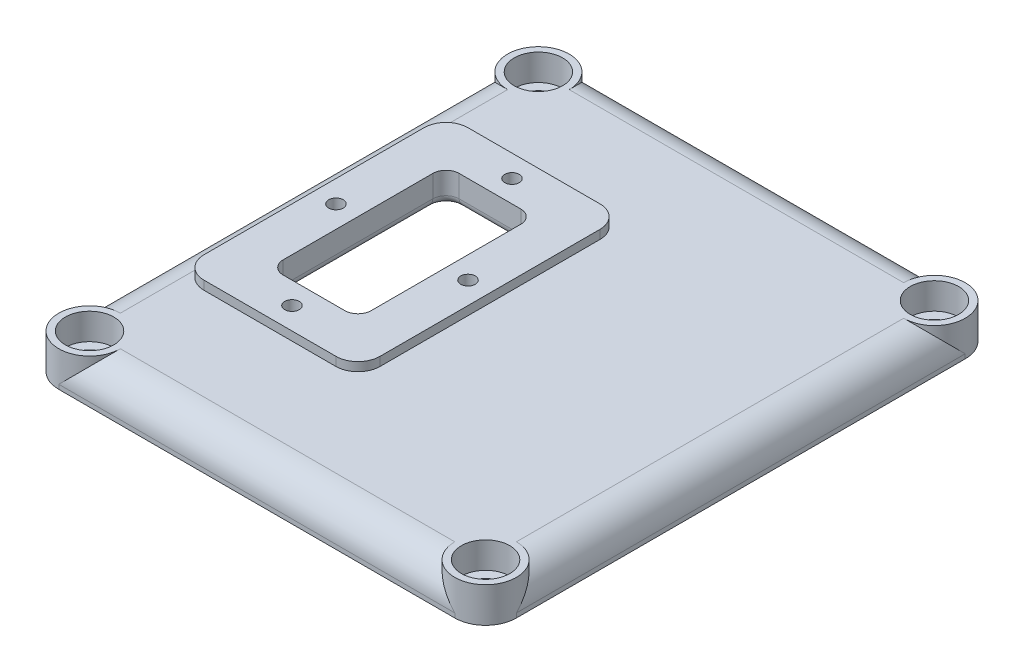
ISO-10303-21;
HEADER;
FILE_DESCRIPTION(('STEP AP214'),'2;1');
FILE_NAME('part.step','',(''),(''),'','','');
FILE_SCHEMA(('AUTOMOTIVE_DESIGN { 1 0 10303 214 1 1 1 1 }'));
ENDSEC;
DATA;
#1=APPLICATION_CONTEXT('core data for automotive mechanical design processes');
#2=APPLICATION_PROTOCOL_DEFINITION('international standard','automotive_design',2000,#1);
#3=PRODUCT_CONTEXT('',#1,'mechanical');
#4=PRODUCT('Part','Part','',(#3));
#5=PRODUCT_RELATED_PRODUCT_CATEGORY('part','',(#4));
#6=PRODUCT_DEFINITION_FORMATION('','',#4);
#7=PRODUCT_DEFINITION_CONTEXT('part definition',#1,'design');
#8=PRODUCT_DEFINITION('design','',#6,#7);
#9=PRODUCT_DEFINITION_SHAPE('','',#8);
#10=(LENGTH_UNIT() NAMED_UNIT(*) SI_UNIT(.MILLI.,.METRE.));
#11=(NAMED_UNIT(*) PLANE_ANGLE_UNIT() SI_UNIT($,.RADIAN.));
#12=(NAMED_UNIT(*) SI_UNIT($,.STERADIAN.) SOLID_ANGLE_UNIT());
#13=UNCERTAINTY_MEASURE_WITH_UNIT(LENGTH_MEASURE(1.E-05),#10,'distance_accuracy_value','');
#14=(GEOMETRIC_REPRESENTATION_CONTEXT(3) GLOBAL_UNCERTAINTY_ASSIGNED_CONTEXT((#13)) GLOBAL_UNIT_ASSIGNED_CONTEXT((#10,
#11,#12)) REPRESENTATION_CONTEXT('',''));
#15=CARTESIAN_POINT('',(0.,0.,0.));
#16=DIRECTION('',(0.,0.,1.));
#17=DIRECTION('',(1.,0.,0.));
#18=AXIS2_PLACEMENT_3D('',#15,#16,#17);
#19=CARTESIAN_POINT('',(45.,0.,51.));
#20=DIRECTION('',(0.,1.,0.));
#21=DIRECTION('',(0.,0.,1.));
#22=AXIS2_PLACEMENT_3D('',#19,#20,#21);
#23=CYLINDRICAL_SURFACE('',#22,3.25);
#24=CARTESIAN_POINT('',(45.,0.,51.));
#25=DIRECTION('',(0.,1.,0.));
#26=DIRECTION('',(0.,0.,1.));
#27=AXIS2_PLACEMENT_3D('',#24,#25,#26);
#28=CIRCLE('',#27,3.25);
#29=CARTESIAN_POINT('',(45.,0.,54.25));
#30=VERTEX_POINT('',#29);
#31=EDGE_CURVE('E1034',#30,#30,#28,.T.);
#32=ORIENTED_EDGE('',*,*,#31,.F.);
#33=EDGE_LOOP('',(#32));
#34=FACE_BOUND('',#33,.T.);
#35=CARTESIAN_POINT('',(45.,2.,51.));
#36=DIRECTION('',(0.,1.,0.));
#37=DIRECTION('',(0.,0.,1.));
#38=AXIS2_PLACEMENT_3D('',#35,#36,#37);
#39=CIRCLE('',#38,3.25);
#40=CARTESIAN_POINT('',(45.,2.,54.25));
#41=VERTEX_POINT('',#40);
#42=EDGE_CURVE('E381',#41,#41,#39,.F.);
#43=ORIENTED_EDGE('',*,*,#42,.F.);
#44=EDGE_LOOP('',(#43));
#45=FACE_BOUND('',#44,.T.);
#46=ADVANCED_FACE('F30',(#34,#45),#23,.F.);
#47=CARTESIAN_POINT('',(-45.,0.,51.));
#48=DIRECTION('',(0.,1.,0.));
#49=DIRECTION('',(0.,0.,1.));
#50=AXIS2_PLACEMENT_3D('',#47,#48,#49);
#51=CYLINDRICAL_SURFACE('',#50,3.25);
#52=CARTESIAN_POINT('',(-45.,0.,51.));
#53=DIRECTION('',(0.,1.,0.));
#54=DIRECTION('',(0.,0.,1.));
#55=AXIS2_PLACEMENT_3D('',#52,#53,#54);
#56=CIRCLE('',#55,3.25);
#57=CARTESIAN_POINT('',(-45.,0.,54.25));
#58=VERTEX_POINT('',#57);
#59=EDGE_CURVE('E1030',#58,#58,#56,.T.);
#60=ORIENTED_EDGE('',*,*,#59,.F.);
#61=EDGE_LOOP('',(#60));
#62=FACE_BOUND('',#61,.T.);
#63=CARTESIAN_POINT('',(-45.,2.,51.));
#64=DIRECTION('',(0.,1.,0.));
#65=DIRECTION('',(0.,0.,1.));
#66=AXIS2_PLACEMENT_3D('',#63,#64,#65);
#67=CIRCLE('',#66,3.25);
#68=CARTESIAN_POINT('',(-45.,2.,54.25));
#69=VERTEX_POINT('',#68);
#70=EDGE_CURVE('E376',#69,#69,#67,.F.);
#71=ORIENTED_EDGE('',*,*,#70,.F.);
#72=EDGE_LOOP('',(#71));
#73=FACE_BOUND('',#72,.T.);
#74=ADVANCED_FACE('F551',(#62,#73),#51,.F.);
#75=CARTESIAN_POINT('',(45.,0.,-51.));
#76=DIRECTION('',(0.,1.,0.));
#77=DIRECTION('',(0.,0.,1.));
#78=AXIS2_PLACEMENT_3D('',#75,#76,#77);
#79=CYLINDRICAL_SURFACE('',#78,3.25);
#80=CARTESIAN_POINT('',(45.,0.,-51.));
#81=DIRECTION('',(0.,1.,0.));
#82=DIRECTION('',(0.,0.,1.));
#83=AXIS2_PLACEMENT_3D('',#80,#81,#82);
#84=CIRCLE('',#83,3.25);
#85=CARTESIAN_POINT('',(45.,0.,-47.75));
#86=VERTEX_POINT('',#85);
#87=EDGE_CURVE('E1037',#86,#86,#84,.T.);
#88=ORIENTED_EDGE('',*,*,#87,.F.);
#89=EDGE_LOOP('',(#88));
#90=FACE_BOUND('',#89,.T.);
#91=CARTESIAN_POINT('',(45.,2.,-51.));
#92=DIRECTION('',(0.,1.,0.));
#93=DIRECTION('',(0.,0.,1.));
#94=AXIS2_PLACEMENT_3D('',#91,#92,#93);
#95=CIRCLE('',#94,3.25);
#96=CARTESIAN_POINT('',(45.,2.,-47.75));
#97=VERTEX_POINT('',#96);
#98=EDGE_CURVE('E371',#97,#97,#95,.F.);
#99=ORIENTED_EDGE('',*,*,#98,.F.);
#100=EDGE_LOOP('',(#99));
#101=FACE_BOUND('',#100,.T.);
#102=ADVANCED_FACE('F557',(#90,#101),#79,.F.);
#103=CARTESIAN_POINT('',(-45.,0.,-51.));
#104=DIRECTION('',(0.,1.,0.));
#105=DIRECTION('',(0.,0.,1.));
#106=AXIS2_PLACEMENT_3D('',#103,#104,#105);
#107=CYLINDRICAL_SURFACE('',#106,3.25);
#108=CARTESIAN_POINT('',(-45.,0.,-51.));
#109=DIRECTION('',(0.,1.,0.));
#110=DIRECTION('',(0.,0.,1.));
#111=AXIS2_PLACEMENT_3D('',#108,#109,#110);
#112=CIRCLE('',#111,3.25);
#113=CARTESIAN_POINT('',(-45.,0.,-47.75));
#114=VERTEX_POINT('',#113);
#115=EDGE_CURVE('E369',#114,#114,#112,.T.);
#116=ORIENTED_EDGE('',*,*,#115,.F.);
#117=EDGE_LOOP('',(#116));
#118=FACE_BOUND('',#117,.T.);
#119=CARTESIAN_POINT('',(-45.,2.,-51.));
#120=DIRECTION('',(0.,1.,0.));
#121=DIRECTION('',(0.,0.,1.));
#122=AXIS2_PLACEMENT_3D('',#119,#120,#121);
#123=CIRCLE('',#122,3.25);
#124=CARTESIAN_POINT('',(-45.,2.,-47.75));
#125=VERTEX_POINT('',#124);
#126=EDGE_CURVE('E366',#125,#125,#123,.F.);
#127=ORIENTED_EDGE('',*,*,#126,.F.);
#128=EDGE_LOOP('',(#127));
#129=FACE_BOUND('',#128,.T.);
#130=ADVANCED_FACE('F603',(#118,#129),#107,.F.);
#131=CARTESIAN_POINT('',(45.,3.,-51.));
#132=DIRECTION('',(0.,-1.,0.));
#133=DIRECTION('',(0.,0.,-1.));
#134=AXIS2_PLACEMENT_3D('',#131,#132,#133);
#135=PLANE('',#134);
#136=CARTESIAN_POINT('',(-40.,3.,0.));
#137=DIRECTION('',(0.,-1.,0.));
#138=DIRECTION('',(0.,0.,-1.));
#139=AXIS2_PLACEMENT_3D('',#136,#137,#138);
#140=CIRCLE('',#139,1.65);
#141=CARTESIAN_POINT('',(-40.,3.,-1.65));
#142=VERTEX_POINT('',#141);
#143=EDGE_CURVE('E1075',#142,#142,#140,.T.);
#144=ORIENTED_EDGE('',*,*,#143,.F.);
#145=EDGE_LOOP('',(#144));
#146=FACE_BOUND('',#145,.T.);
#147=CARTESIAN_POINT('',(-25.,3.,-25.));
#148=DIRECTION('',(0.,-1.,0.));
#149=DIRECTION('',(0.,0.,-1.));
#150=AXIS2_PLACEMENT_3D('',#147,#148,#149);
#151=CIRCLE('',#150,1.64999999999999);
#152=CARTESIAN_POINT('',(-25.,3.,-26.65));
#153=VERTEX_POINT('',#152);
#154=EDGE_CURVE('E1069',#153,#153,#151,.T.);
#155=ORIENTED_EDGE('',*,*,#154,.F.);
#156=EDGE_LOOP('',(#155));
#157=FACE_BOUND('',#156,.T.);
#158=CARTESIAN_POINT('',(-10.,3.,0.));
#159=DIRECTION('',(0.,-1.,0.));
#160=DIRECTION('',(0.,0.,-1.));
#161=AXIS2_PLACEMENT_3D('',#158,#159,#160);
#162=CIRCLE('',#161,1.64999999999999);
#163=CARTESIAN_POINT('',(-10.,3.,-1.64999999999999));
#164=VERTEX_POINT('',#163);
#165=EDGE_CURVE('E1063',#164,#164,#162,.T.);
#166=ORIENTED_EDGE('',*,*,#165,.F.);
#167=EDGE_LOOP('',(#166));
#168=FACE_BOUND('',#167,.T.);
#169=CARTESIAN_POINT('',(-25.,3.,25.));
#170=DIRECTION('',(0.,-1.,0.));
#171=DIRECTION('',(0.,0.,-1.));
#172=AXIS2_PLACEMENT_3D('',#169,#170,#171);
#173=CIRCLE('',#172,1.64999999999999);
#174=CARTESIAN_POINT('',(-25.,3.,23.35));
#175=VERTEX_POINT('',#174);
#176=EDGE_CURVE('E480',#175,#175,#173,.T.);
#177=ORIENTED_EDGE('',*,*,#176,.F.);
#178=EDGE_LOOP('',(#177));
#179=FACE_BOUND('',#178,.T.);
#180=DIRECTION('',(-1.,0.,0.));
#181=VECTOR('',#180,1.);
#182=CARTESIAN_POINT('',(-18.,3.,22.));
#183=LINE('',#182,#181);
#184=CARTESIAN_POINT('',(-32.,3.,22.));
#185=VERTEX_POINT('',#184);
#186=CARTESIAN_POINT('',(-18.,3.,22.));
#187=VERTEX_POINT('',#186);
#188=EDGE_CURVE('E405',#185,#187,#183,.F.);
#189=ORIENTED_EDGE('',*,*,#188,.T.);
#190=CARTESIAN_POINT('',(-18.,3.,17.));
#191=DIRECTION('',(0.,-1.,0.));
#192=DIRECTION('',(0.,0.,-1.));
#193=AXIS2_PLACEMENT_3D('',#190,#191,#192);
#194=CIRCLE('',#193,5.);
#195=CARTESIAN_POINT('',(-13.,3.,17.));
#196=VERTEX_POINT('',#195);
#197=EDGE_CURVE('E419',#187,#196,#194,.F.);
#198=ORIENTED_EDGE('',*,*,#197,.T.);
#199=DIRECTION('',(0.,0.,1.));
#200=VECTOR('',#199,1.);
#201=CARTESIAN_POINT('',(-13.,3.,-17.));
#202=LINE('',#201,#200);
#203=CARTESIAN_POINT('',(-13.,3.,-17.));
#204=VERTEX_POINT('',#203);
#205=EDGE_CURVE('E417',#196,#204,#202,.F.);
#206=ORIENTED_EDGE('',*,*,#205,.T.);
#207=CARTESIAN_POINT('',(-18.,3.,-17.));
#208=DIRECTION('',(0.,-1.,0.));
#209=DIRECTION('',(0.,0.,-1.));
#210=AXIS2_PLACEMENT_3D('',#207,#208,#209);
#211=CIRCLE('',#210,5.);
#212=CARTESIAN_POINT('',(-18.,3.,-22.));
#213=VERTEX_POINT('',#212);
#214=EDGE_CURVE('E415',#204,#213,#211,.F.);
#215=ORIENTED_EDGE('',*,*,#214,.T.);
#216=DIRECTION('',(1.,0.,0.));
#217=VECTOR('',#216,1.);
#218=CARTESIAN_POINT('',(-32.,3.,-22.));
#219=LINE('',#218,#217);
#220=CARTESIAN_POINT('',(-32.,3.,-22.));
#221=VERTEX_POINT('',#220);
#222=EDGE_CURVE('E413',#213,#221,#219,.F.);
#223=ORIENTED_EDGE('',*,*,#222,.T.);
#224=CARTESIAN_POINT('',(-32.,3.,-17.));
#225=DIRECTION('',(0.,-1.,0.));
#226=DIRECTION('',(0.,0.,-1.));
#227=AXIS2_PLACEMENT_3D('',#224,#225,#226);
#228=CIRCLE('',#227,5.);
#229=CARTESIAN_POINT('',(-37.,3.,-17.));
#230=VERTEX_POINT('',#229);
#231=EDGE_CURVE('E411',#221,#230,#228,.F.);
#232=ORIENTED_EDGE('',*,*,#231,.T.);
#233=DIRECTION('',(0.,0.,-1.));
#234=VECTOR('',#233,1.);
#235=CARTESIAN_POINT('',(-37.,3.,17.));
#236=LINE('',#235,#234);
#237=CARTESIAN_POINT('',(-37.,3.,17.));
#238=VERTEX_POINT('',#237);
#239=EDGE_CURVE('E409',#230,#238,#236,.F.);
#240=ORIENTED_EDGE('',*,*,#239,.T.);
#241=CARTESIAN_POINT('',(-32.,3.,17.));
#242=DIRECTION('',(0.,-1.,0.));
#243=DIRECTION('',(0.,0.,-1.));
#244=AXIS2_PLACEMENT_3D('',#241,#242,#243);
#245=CIRCLE('',#244,5.);
#246=EDGE_CURVE('E407',#238,#185,#245,.F.);
#247=ORIENTED_EDGE('',*,*,#246,.T.);
#248=EDGE_LOOP('',(#189,#198,#206,#215,#223,#232,#240,#247));
#249=FACE_BOUND('',#248,.T.);
#250=CARTESIAN_POINT('',(45.,3.,-51.));
#251=DIRECTION('',(0.,-1.,0.));
#252=DIRECTION('',(0.,0.,-1.));
#253=AXIS2_PLACEMENT_3D('',#250,#251,#252);
#254=CIRCLE('',#253,9.);
#255=CARTESIAN_POINT('',(36.2250356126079,3.,-49.));
#256=VERTEX_POINT('',#255);
#257=CARTESIAN_POINT('',(43.,3.,-42.2250356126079));
#258=VERTEX_POINT('',#257);
#259=EDGE_CURVE('E401',#256,#258,#254,.F.);
#260=ORIENTED_EDGE('',*,*,#259,.T.);
#261=DIRECTION('',(0.,0.,1.));
#262=VECTOR('',#261,1.);
#263=CARTESIAN_POINT('',(43.,3.,-51.));
#264=LINE('',#263,#262);
#265=CARTESIAN_POINT('',(43.,3.,42.2250356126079));
#266=VERTEX_POINT('',#265);
#267=EDGE_CURVE('E403',#258,#266,#264,.T.);
#268=ORIENTED_EDGE('',*,*,#267,.T.);
#269=CARTESIAN_POINT('',(45.,3.,51.));
#270=DIRECTION('',(0.,-1.,0.));
#271=DIRECTION('',(0.,0.,-1.));
#272=AXIS2_PLACEMENT_3D('',#269,#270,#271);
#273=CIRCLE('',#272,9.);
#274=CARTESIAN_POINT('',(36.2250356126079,3.,49.));
#275=VERTEX_POINT('',#274);
#276=EDGE_CURVE('E399',#266,#275,#273,.F.);
#277=ORIENTED_EDGE('',*,*,#276,.T.);
#278=DIRECTION('',(-1.,0.,0.));
#279=VECTOR('',#278,1.);
#280=CARTESIAN_POINT('',(45.,3.,49.));
#281=LINE('',#280,#279);
#282=CARTESIAN_POINT('',(-36.2250356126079,3.,49.));
#283=VERTEX_POINT('',#282);
#284=EDGE_CURVE('E395',#275,#283,#281,.T.);
#285=ORIENTED_EDGE('',*,*,#284,.T.);
#286=CARTESIAN_POINT('',(-45.,3.,51.));
#287=DIRECTION('',(0.,-1.,0.));
#288=DIRECTION('',(0.,0.,-1.));
#289=AXIS2_PLACEMENT_3D('',#286,#287,#288);
#290=CIRCLE('',#289,9.);
#291=CARTESIAN_POINT('',(-43.,3.,42.2250356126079));
#292=VERTEX_POINT('',#291);
#293=EDGE_CURVE('E390',#283,#292,#290,.F.);
#294=ORIENTED_EDGE('',*,*,#293,.T.);
#295=DIRECTION('',(0.,0.,-1.));
#296=VECTOR('',#295,1.);
#297=CARTESIAN_POINT('',(-43.,3.,-51.));
#298=LINE('',#297,#296);
#299=CARTESIAN_POINT('',(-43.,3.,-42.2250356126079));
#300=VERTEX_POINT('',#299);
#301=EDGE_CURVE('E388',#292,#300,#298,.T.);
#302=ORIENTED_EDGE('',*,*,#301,.T.);
#303=CARTESIAN_POINT('',(-45.,3.,-51.));
#304=DIRECTION('',(0.,-1.,0.));
#305=DIRECTION('',(0.,0.,-1.));
#306=AXIS2_PLACEMENT_3D('',#303,#304,#305);
#307=CIRCLE('',#306,9.);
#308=CARTESIAN_POINT('',(-36.2250356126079,3.,-49.));
#309=VERTEX_POINT('',#308);
#310=EDGE_CURVE('E392',#300,#309,#307,.F.);
#311=ORIENTED_EDGE('',*,*,#310,.T.);
#312=DIRECTION('',(1.,0.,0.));
#313=VECTOR('',#312,1.);
#314=CARTESIAN_POINT('',(45.,3.,-49.));
#315=LINE('',#314,#313);
#316=EDGE_CURVE('E397',#309,#256,#315,.T.);
#317=ORIENTED_EDGE('',*,*,#316,.T.);
#318=EDGE_LOOP('',(#260,#268,#277,#285,#294,#302,#311,#317));
#319=FACE_BOUND('',#318,.T.);
#320=ADVANCED_FACE('F599',(#146,#157,#168,#179,#249,#319),#135,.T.);
#321=CARTESIAN_POINT('',(-45.,3.,-51.));
#322=DIRECTION('',(0.,0.,-1.));
#323=DIRECTION('',(-1.,0.,0.));
#324=AXIS2_PLACEMENT_3D('',#321,#322,#323);
#325=PLANE('',#324);
#326=DIRECTION('',(0.,-1.,0.));
#327=VECTOR('',#326,1.);
#328=CARTESIAN_POINT('',(38.,8.,-51.));
#329=LINE('',#328,#327);
#330=CARTESIAN_POINT('',(38.,1.,-51.));
#331=VERTEX_POINT('',#330);
#332=CARTESIAN_POINT('',(38.,0.,-51.));
#333=VERTEX_POINT('',#332);
#334=EDGE_CURVE('E912',#331,#333,#329,.T.);
#335=ORIENTED_EDGE('',*,*,#334,.F.);
#336=DIRECTION('',(1.,0.,0.));
#337=VECTOR('',#336,1.);
#338=CARTESIAN_POINT('',(-45.,1.,-51.));
#339=LINE('',#338,#337);
#340=CARTESIAN_POINT('',(-38.,1.,-51.));
#341=VERTEX_POINT('',#340);
#342=EDGE_CURVE('E444',#331,#341,#339,.F.);
#343=ORIENTED_EDGE('',*,*,#342,.T.);
#344=DIRECTION('',(0.,-1.,0.));
#345=VECTOR('',#344,1.);
#346=CARTESIAN_POINT('',(-38.,8.,-51.));
#347=LINE('',#346,#345);
#348=CARTESIAN_POINT('',(-38.,0.,-51.));
#349=VERTEX_POINT('',#348);
#350=EDGE_CURVE('E1025',#349,#341,#347,.F.);
#351=ORIENTED_EDGE('',*,*,#350,.F.);
#352=DIRECTION('',(1.,0.,0.));
#353=VECTOR('',#352,1.);
#354=CARTESIAN_POINT('',(-45.,0.,-51.));
#355=LINE('',#354,#353);
#356=EDGE_CURVE('E784',#349,#333,#355,.T.);
#357=ORIENTED_EDGE('',*,*,#356,.T.);
#358=EDGE_LOOP('',(#335,#343,#351,#357));
#359=FACE_BOUND('',#358,.T.);
#360=ADVANCED_FACE('F602',(#359),#325,.F.);
#361=CARTESIAN_POINT('',(-45.,1.,-51.));
#362=DIRECTION('',(1.,0.,0.));
#363=DIRECTION('',(0.,0.,-1.));
#364=AXIS2_PLACEMENT_3D('',#361,#362,#363);
#365=CYLINDRICAL_SURFACE('',#364,7.);
#366=DIRECTION('',(-1.,0.,0.));
#367=VECTOR('',#366,1.);
#368=CARTESIAN_POINT('',(45.,1.,-58.));
#369=LINE('',#368,#367);
#370=CARTESIAN_POINT('',(-45.,1.,-58.));
#371=VERTEX_POINT('',#370);
#372=CARTESIAN_POINT('',(45.,1.,-58.));
#373=VERTEX_POINT('',#372);
#374=EDGE_CURVE('E342',#371,#373,#369,.F.);
#375=ORIENTED_EDGE('',*,*,#374,.F.);
#376=CARTESIAN_POINT('',(-45.,1.,-51.));
#377=DIRECTION('',(0.707106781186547,-0.707106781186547,0.));
#378=DIRECTION('',(0.707106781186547,0.707106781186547,0.));
#379=AXIS2_PLACEMENT_3D('',#376,#377,#378);
#380=ELLIPSE('',#379,9.89949493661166,7.);
#381=CARTESIAN_POINT('',(-38.,8.,-51.));
#382=VERTEX_POINT('',#381);
#383=EDGE_CURVE('E1018',#371,#382,#380,.T.);
#384=ORIENTED_EDGE('',*,*,#383,.T.);
#385=DIRECTION('',(-1.,0.,0.));
#386=VECTOR('',#385,1.);
#387=CARTESIAN_POINT('',(-45.,8.,-51.));
#388=LINE('',#387,#386);
#389=CARTESIAN_POINT('',(38.,8.,-51.));
#390=VERTEX_POINT('',#389);
#391=EDGE_CURVE('E335',#390,#382,#388,.T.);
#392=ORIENTED_EDGE('',*,*,#391,.F.);
#393=CARTESIAN_POINT('',(45.,1.,-51.));
#394=DIRECTION('',(0.707106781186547,0.707106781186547,0.));
#395=DIRECTION('',(0.707106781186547,-0.707106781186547,0.));
#396=AXIS2_PLACEMENT_3D('',#393,#394,#395);
#397=ELLIPSE('',#396,9.89949493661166,7.);
#398=EDGE_CURVE('E363',#390,#373,#397,.F.);
#399=ORIENTED_EDGE('',*,*,#398,.T.);
#400=EDGE_LOOP('',(#375,#384,#392,#399));
#401=FACE_BOUND('',#400,.T.);
#402=ADVANCED_FACE('F608',(#401),#365,.T.);
#403=CARTESIAN_POINT('',(-45.,3.,51.));
#404=DIRECTION('',(-1.,0.,0.));
#405=DIRECTION('',(0.,0.,1.));
#406=AXIS2_PLACEMENT_3D('',#403,#404,#405);
#407=PLANE('',#406);
#408=DIRECTION('',(0.,-1.,0.));
#409=VECTOR('',#408,1.);
#410=CARTESIAN_POINT('',(-45.,8.,-44.));
#411=LINE('',#410,#409);
#412=CARTESIAN_POINT('',(-45.,1.,-44.));
#413=VERTEX_POINT('',#412);
#414=CARTESIAN_POINT('',(-45.,0.,-44.));
#415=VERTEX_POINT('',#414);
#416=EDGE_CURVE('E326',#413,#415,#411,.T.);
#417=ORIENTED_EDGE('',*,*,#416,.F.);
#418=DIRECTION('',(0.,0.,-1.));
#419=VECTOR('',#418,1.);
#420=CARTESIAN_POINT('',(-45.,1.,51.));
#421=LINE('',#420,#419);
#422=CARTESIAN_POINT('',(-45.,1.,44.));
#423=VERTEX_POINT('',#422);
#424=EDGE_CURVE('E11',#413,#423,#421,.F.);
#425=ORIENTED_EDGE('',*,*,#424,.T.);
#426=DIRECTION('',(0.,-1.,0.));
#427=VECTOR('',#426,1.);
#428=CARTESIAN_POINT('',(-45.,8.,44.));
#429=LINE('',#428,#427);
#430=CARTESIAN_POINT('',(-45.,0.,44.));
#431=VERTEX_POINT('',#430);
#432=EDGE_CURVE('E933',#431,#423,#429,.F.);
#433=ORIENTED_EDGE('',*,*,#432,.F.);
#434=DIRECTION('',(0.,0.,-1.));
#435=VECTOR('',#434,1.);
#436=CARTESIAN_POINT('',(-45.,0.,51.));
#437=LINE('',#436,#435);
#438=EDGE_CURVE('E794',#431,#415,#437,.T.);
#439=ORIENTED_EDGE('',*,*,#438,.T.);
#440=EDGE_LOOP('',(#417,#425,#433,#439));
#441=FACE_BOUND('',#440,.T.);
#442=ADVANCED_FACE('F605',(#441),#407,.F.);
#443=CARTESIAN_POINT('',(-45.,1.,51.));
#444=DIRECTION('',(0.,0.,-1.));
#445=DIRECTION('',(-1.,0.,0.));
#446=AXIS2_PLACEMENT_3D('',#443,#444,#445);
#447=CYLINDRICAL_SURFACE('',#446,7.);
#448=DIRECTION('',(0.,0.,1.));
#449=VECTOR('',#448,1.);
#450=CARTESIAN_POINT('',(-45.,8.,51.));
#451=LINE('',#450,#449);
#452=CARTESIAN_POINT('',(-45.,8.,-44.));
#453=VERTEX_POINT('',#452);
#454=CARTESIAN_POINT('',(-45.,8.,-25.));
#455=VERTEX_POINT('',#454);
#456=EDGE_CURVE('E332',#453,#455,#451,.T.);
#457=ORIENTED_EDGE('',*,*,#456,.F.);
#458=CARTESIAN_POINT('',(-45.,1.,-51.));
#459=DIRECTION('',(0.,0.707106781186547,-0.707106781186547));
#460=DIRECTION('',(0.,-0.707106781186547,-0.707106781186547));
#461=AXIS2_PLACEMENT_3D('',#458,#459,#460);
#462=ELLIPSE('',#461,9.89949493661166,7.);
#463=CARTESIAN_POINT('',(-52.,1.,-51.));
#464=VERTEX_POINT('',#463);
#465=EDGE_CURVE('E315',#453,#464,#462,.F.);
#466=ORIENTED_EDGE('',*,*,#465,.T.);
#467=DIRECTION('',(0.,0.,1.));
#468=VECTOR('',#467,1.);
#469=CARTESIAN_POINT('',(-52.,1.,-51.));
#470=LINE('',#469,#468);
#471=CARTESIAN_POINT('',(-52.,1.,51.));
#472=VERTEX_POINT('',#471);
#473=EDGE_CURVE('E356',#472,#464,#470,.F.);
#474=ORIENTED_EDGE('',*,*,#473,.F.);
#475=CARTESIAN_POINT('',(-45.,1.,51.));
#476=DIRECTION('',(0.,-0.707106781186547,-0.707106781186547));
#477=DIRECTION('',(0.,0.707106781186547,-0.707106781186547));
#478=AXIS2_PLACEMENT_3D('',#475,#476,#477);
#479=ELLIPSE('',#478,9.89949493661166,7.);
#480=CARTESIAN_POINT('',(-45.,8.,44.));
#481=VERTEX_POINT('',#480);
#482=EDGE_CURVE('E358',#472,#481,#479,.T.);
#483=ORIENTED_EDGE('',*,*,#482,.T.);
#484=DIRECTION('',(0.,0.,1.));
#485=VECTOR('',#484,1.);
#486=CARTESIAN_POINT('',(-45.,8.,51.));
#487=LINE('',#486,#485);
#488=CARTESIAN_POINT('',(-45.,8.,25.));
#489=VERTEX_POINT('',#488);
#490=EDGE_CURVE('E891',#489,#481,#487,.T.);
#491=ORIENTED_EDGE('',*,*,#490,.F.);
#492=DIRECTION('',(0.,0.,1.));
#493=VECTOR('',#492,1.);
#494=CARTESIAN_POINT('',(-45.,8.,-25.));
#495=LINE('',#494,#493);
#496=EDGE_CURVE('E341',#455,#489,#495,.T.);
#497=ORIENTED_EDGE('',*,*,#496,.F.);
#498=EDGE_LOOP('',(#457,#466,#474,#483,#491,#497));
#499=FACE_BOUND('',#498,.T.);
#500=ADVANCED_FACE('F339',(#499),#447,.T.);
#501=CARTESIAN_POINT('',(45.,3.,-51.));
#502=DIRECTION('',(1.,0.,0.));
#503=DIRECTION('',(0.,0.,-1.));
#504=AXIS2_PLACEMENT_3D('',#501,#502,#503);
#505=PLANE('',#504);
#506=DIRECTION('',(0.,-1.,0.));
#507=VECTOR('',#506,1.);
#508=CARTESIAN_POINT('',(45.,8.,44.));
#509=LINE('',#508,#507);
#510=CARTESIAN_POINT('',(45.,1.,44.));
#511=VERTEX_POINT('',#510);
#512=CARTESIAN_POINT('',(45.,0.,44.));
#513=VERTEX_POINT('',#512);
#514=EDGE_CURVE('E916',#511,#513,#509,.T.);
#515=ORIENTED_EDGE('',*,*,#514,.F.);
#516=DIRECTION('',(0.,0.,1.));
#517=VECTOR('',#516,1.);
#518=CARTESIAN_POINT('',(45.,1.,-51.));
#519=LINE('',#518,#517);
#520=CARTESIAN_POINT('',(45.,1.,-44.));
#521=VERTEX_POINT('',#520);
#522=EDGE_CURVE('E446',#511,#521,#519,.F.);
#523=ORIENTED_EDGE('',*,*,#522,.T.);
#524=DIRECTION('',(0.,-1.,0.));
#525=VECTOR('',#524,1.);
#526=CARTESIAN_POINT('',(45.,8.,-44.));
#527=LINE('',#526,#525);
#528=CARTESIAN_POINT('',(45.,0.,-44.));
#529=VERTEX_POINT('',#528);
#530=EDGE_CURVE('E907',#529,#521,#527,.F.);
#531=ORIENTED_EDGE('',*,*,#530,.F.);
#532=DIRECTION('',(0.,0.,1.));
#533=VECTOR('',#532,1.);
#534=CARTESIAN_POINT('',(45.,0.,-51.));
#535=LINE('',#534,#533);
#536=EDGE_CURVE('E787',#529,#513,#535,.T.);
#537=ORIENTED_EDGE('',*,*,#536,.T.);
#538=EDGE_LOOP('',(#515,#523,#531,#537));
#539=FACE_BOUND('',#538,.T.);
#540=ADVANCED_FACE('F615',(#539),#505,.F.);
#541=CARTESIAN_POINT('',(45.,1.,51.));
#542=DIRECTION('',(0.,0.,1.));
#543=DIRECTION('',(1.,0.,0.));
#544=AXIS2_PLACEMENT_3D('',#541,#542,#543);
#545=CYLINDRICAL_SURFACE('',#544,7.);
#546=DIRECTION('',(0.,0.,-1.));
#547=VECTOR('',#546,1.);
#548=CARTESIAN_POINT('',(52.,1.,51.));
#549=LINE('',#548,#547);
#550=CARTESIAN_POINT('',(52.,1.,-51.));
#551=VERTEX_POINT('',#550);
#552=CARTESIAN_POINT('',(52.,1.,51.));
#553=VERTEX_POINT('',#552);
#554=EDGE_CURVE('E345',#551,#553,#549,.F.);
#555=ORIENTED_EDGE('',*,*,#554,.F.);
#556=CARTESIAN_POINT('',(45.,1.,-51.));
#557=DIRECTION('',(0.,-0.707106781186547,0.707106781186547));
#558=DIRECTION('',(0.,0.707106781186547,0.707106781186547));
#559=AXIS2_PLACEMENT_3D('',#556,#557,#558);
#560=ELLIPSE('',#559,9.89949493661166,7.);
#561=CARTESIAN_POINT('',(45.,8.,-44.));
#562=VERTEX_POINT('',#561);
#563=EDGE_CURVE('E904',#551,#562,#560,.T.);
#564=ORIENTED_EDGE('',*,*,#563,.T.);
#565=DIRECTION('',(0.,0.,-1.));
#566=VECTOR('',#565,1.);
#567=CARTESIAN_POINT('',(45.,8.,-51.));
#568=LINE('',#567,#566);
#569=CARTESIAN_POINT('',(45.,8.,44.));
#570=VERTEX_POINT('',#569);
#571=EDGE_CURVE('E347',#570,#562,#568,.T.);
#572=ORIENTED_EDGE('',*,*,#571,.F.);
#573=CARTESIAN_POINT('',(45.,1.,51.));
#574=DIRECTION('',(0.,0.707106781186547,0.707106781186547));
#575=DIRECTION('',(0.,-0.707106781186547,0.707106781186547));
#576=AXIS2_PLACEMENT_3D('',#573,#574,#575);
#577=ELLIPSE('',#576,9.89949493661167,7.);
#578=EDGE_CURVE('E361',#570,#553,#577,.F.);
#579=ORIENTED_EDGE('',*,*,#578,.T.);
#580=EDGE_LOOP('',(#555,#564,#572,#579));
#581=FACE_BOUND('',#580,.T.);
#582=ADVANCED_FACE('F614',(#581),#545,.T.);
#583=CARTESIAN_POINT('',(-45.,3.,51.));
#584=DIRECTION('',(0.,0.,1.));
#585=DIRECTION('',(1.,0.,0.));
#586=AXIS2_PLACEMENT_3D('',#583,#584,#585);
#587=PLANE('',#586);
#588=DIRECTION('',(0.,-1.,0.));
#589=VECTOR('',#588,1.);
#590=CARTESIAN_POINT('',(-38.,8.,51.));
#591=LINE('',#590,#589);
#592=CARTESIAN_POINT('',(-38.,1.,51.));
#593=VERTEX_POINT('',#592);
#594=CARTESIAN_POINT('',(-38.,0.,51.));
#595=VERTEX_POINT('',#594);
#596=EDGE_CURVE('E931',#593,#595,#591,.T.);
#597=ORIENTED_EDGE('',*,*,#596,.F.);
#598=DIRECTION('',(-1.,0.,0.));
#599=VECTOR('',#598,1.);
#600=CARTESIAN_POINT('',(-45.,1.,51.));
#601=LINE('',#600,#599);
#602=CARTESIAN_POINT('',(38.,1.,51.));
#603=VERTEX_POINT('',#602);
#604=EDGE_CURVE('E43',#593,#603,#601,.F.);
#605=ORIENTED_EDGE('',*,*,#604,.T.);
#606=DIRECTION('',(0.,-1.,0.));
#607=VECTOR('',#606,1.);
#608=CARTESIAN_POINT('',(38.,8.,51.));
#609=LINE('',#608,#607);
#610=CARTESIAN_POINT('',(38.,0.,51.));
#611=VERTEX_POINT('',#610);
#612=EDGE_CURVE('E919',#611,#603,#609,.F.);
#613=ORIENTED_EDGE('',*,*,#612,.F.);
#614=DIRECTION('',(-1.,0.,0.));
#615=VECTOR('',#614,1.);
#616=CARTESIAN_POINT('',(-45.,0.,51.));
#617=LINE('',#616,#615);
#618=EDGE_CURVE('E791',#611,#595,#617,.T.);
#619=ORIENTED_EDGE('',*,*,#618,.T.);
#620=EDGE_LOOP('',(#597,#605,#613,#619));
#621=FACE_BOUND('',#620,.T.);
#622=ADVANCED_FACE('F610',(#621),#587,.F.);
#623=CARTESIAN_POINT('',(-45.,1.,51.));
#624=DIRECTION('',(-1.,0.,0.));
#625=DIRECTION('',(0.,0.,1.));
#626=AXIS2_PLACEMENT_3D('',#623,#624,#625);
#627=CYLINDRICAL_SURFACE('',#626,7.);
#628=DIRECTION('',(1.,0.,0.));
#629=VECTOR('',#628,1.);
#630=CARTESIAN_POINT('',(-45.,1.,58.));
#631=LINE('',#630,#629);
#632=CARTESIAN_POINT('',(45.,1.,58.));
#633=VERTEX_POINT('',#632);
#634=CARTESIAN_POINT('',(-45.,1.,58.));
#635=VERTEX_POINT('',#634);
#636=EDGE_CURVE('E353',#633,#635,#631,.F.);
#637=ORIENTED_EDGE('',*,*,#636,.F.);
#638=CARTESIAN_POINT('',(45.,1.,51.));
#639=DIRECTION('',(-0.707106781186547,-0.707106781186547,0.));
#640=DIRECTION('',(-0.707106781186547,0.707106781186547,0.));
#641=AXIS2_PLACEMENT_3D('',#638,#639,#640);
#642=ELLIPSE('',#641,9.89949493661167,7.);
#643=CARTESIAN_POINT('',(38.,8.,51.));
#644=VERTEX_POINT('',#643);
#645=EDGE_CURVE('E921',#633,#644,#642,.T.);
#646=ORIENTED_EDGE('',*,*,#645,.T.);
#647=DIRECTION('',(1.,0.,0.));
#648=VECTOR('',#647,1.);
#649=CARTESIAN_POINT('',(45.,8.,51.));
#650=LINE('',#649,#648);
#651=CARTESIAN_POINT('',(-38.,8.,51.));
#652=VERTEX_POINT('',#651);
#653=EDGE_CURVE('E894',#652,#644,#650,.T.);
#654=ORIENTED_EDGE('',*,*,#653,.F.);
#655=CARTESIAN_POINT('',(-45.,1.,51.));
#656=DIRECTION('',(-0.707106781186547,0.707106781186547,0.));
#657=DIRECTION('',(-0.707106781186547,-0.707106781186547,0.));
#658=AXIS2_PLACEMENT_3D('',#655,#656,#657);
#659=ELLIPSE('',#658,9.89949493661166,7.);
#660=EDGE_CURVE('E928',#652,#635,#659,.F.);
#661=ORIENTED_EDGE('',*,*,#660,.T.);
#662=EDGE_LOOP('',(#637,#646,#654,#661));
#663=FACE_BOUND('',#662,.T.);
#664=ADVANCED_FACE('F613',(#663),#627,.T.);
#665=CARTESIAN_POINT('',(-45.,8.,51.));
#666=DIRECTION('',(0.,1.,0.));
#667=DIRECTION('',(0.,0.,1.));
#668=AXIS2_PLACEMENT_3D('',#665,#666,#667);
#669=PLANE('',#668);
#670=CARTESIAN_POINT('',(45.,8.,51.));
#671=DIRECTION('',(0.,1.,0.));
#672=DIRECTION('',(0.,0.,1.));
#673=AXIS2_PLACEMENT_3D('',#670,#671,#672);
#674=CIRCLE('',#673,5.5);
#675=CARTESIAN_POINT('',(45.,8.,56.5));
#676=VERTEX_POINT('',#675);
#677=EDGE_CURVE('E471',#676,#676,#674,.T.);
#678=ORIENTED_EDGE('',*,*,#677,.F.);
#679=EDGE_LOOP('',(#678));
#680=FACE_BOUND('',#679,.T.);
#681=CARTESIAN_POINT('',(-45.,8.,51.));
#682=DIRECTION('',(0.,1.,0.));
#683=DIRECTION('',(0.,0.,1.));
#684=AXIS2_PLACEMENT_3D('',#681,#682,#683);
#685=CIRCLE('',#684,5.5);
#686=CARTESIAN_POINT('',(-45.,8.,56.5));
#687=VERTEX_POINT('',#686);
#688=EDGE_CURVE('E384',#687,#687,#685,.T.);
#689=ORIENTED_EDGE('',*,*,#688,.F.);
#690=EDGE_LOOP('',(#689));
#691=FACE_BOUND('',#690,.T.);
#692=CARTESIAN_POINT('',(45.,8.,-51.));
#693=DIRECTION('',(0.,1.,0.));
#694=DIRECTION('',(0.,0.,1.));
#695=AXIS2_PLACEMENT_3D('',#692,#693,#694);
#696=CIRCLE('',#695,5.5);
#697=CARTESIAN_POINT('',(45.,8.,-45.5));
#698=VERTEX_POINT('',#697);
#699=EDGE_CURVE('E379',#698,#698,#696,.T.);
#700=ORIENTED_EDGE('',*,*,#699,.F.);
#701=EDGE_LOOP('',(#700));
#702=FACE_BOUND('',#701,.T.);
#703=CARTESIAN_POINT('',(-45.,8.,-51.));
#704=DIRECTION('',(0.,1.,0.));
#705=DIRECTION('',(0.,0.,1.));
#706=AXIS2_PLACEMENT_3D('',#703,#704,#705);
#707=CIRCLE('',#706,5.5);
#708=CARTESIAN_POINT('',(-45.,8.,-45.5));
#709=VERTEX_POINT('',#708);
#710=EDGE_CURVE('E374',#709,#709,#707,.T.);
#711=ORIENTED_EDGE('',*,*,#710,.F.);
#712=EDGE_LOOP('',(#711));
#713=FACE_BOUND('',#712,.T.);
#714=ORIENTED_EDGE('',*,*,#391,.T.);
#715=CARTESIAN_POINT('',(-45.,8.,-51.));
#716=DIRECTION('',(0.,1.,0.));
#717=DIRECTION('',(0.,0.,1.));
#718=AXIS2_PLACEMENT_3D('',#715,#716,#717);
#719=CIRCLE('',#718,6.99999999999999);
#720=EDGE_CURVE('E318',#382,#453,#719,.T.);
#721=ORIENTED_EDGE('',*,*,#720,.T.);
#722=ORIENTED_EDGE('',*,*,#456,.T.);
#723=CARTESIAN_POINT('',(-40.,8.,-25.));
#724=DIRECTION('',(0.,1.,0.));
#725=DIRECTION('',(0.,0.,-1.));
#726=AXIS2_PLACEMENT_3D('',#723,#724,#725);
#727=CIRCLE('',#726,5.);
#728=CARTESIAN_POINT('',(-40.,8.,-30.));
#729=VERTEX_POINT('',#728);
#730=EDGE_CURVE('E828',#729,#455,#727,.T.);
#731=ORIENTED_EDGE('',*,*,#730,.F.);
#732=DIRECTION('',(-1.,0.,0.));
#733=VECTOR('',#732,1.);
#734=CARTESIAN_POINT('',(-40.,8.,-30.));
#735=LINE('',#734,#733);
#736=CARTESIAN_POINT('',(-9.99999999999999,8.,-30.));
#737=VERTEX_POINT('',#736);
#738=EDGE_CURVE('E826',#737,#729,#735,.T.);
#739=ORIENTED_EDGE('',*,*,#738,.F.);
#740=CARTESIAN_POINT('',(-9.99999999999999,8.,-25.));
#741=DIRECTION('',(0.,1.,0.));
#742=DIRECTION('',(0.,0.,-1.));
#743=AXIS2_PLACEMENT_3D('',#740,#741,#742);
#744=CIRCLE('',#743,5.);
#745=CARTESIAN_POINT('',(-4.99999999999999,8.,-25.));
#746=VERTEX_POINT('',#745);
#747=EDGE_CURVE('E824',#746,#737,#744,.T.);
#748=ORIENTED_EDGE('',*,*,#747,.F.);
#749=DIRECTION('',(0.,0.,-1.));
#750=VECTOR('',#749,1.);
#751=CARTESIAN_POINT('',(-4.99999999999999,8.,25.));
#752=LINE('',#751,#750);
#753=CARTESIAN_POINT('',(-4.99999999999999,8.,25.));
#754=VERTEX_POINT('',#753);
#755=EDGE_CURVE('E822',#754,#746,#752,.T.);
#756=ORIENTED_EDGE('',*,*,#755,.F.);
#757=CARTESIAN_POINT('',(-9.99999999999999,8.,25.));
#758=DIRECTION('',(0.,1.,0.));
#759=DIRECTION('',(0.,0.,1.));
#760=AXIS2_PLACEMENT_3D('',#757,#758,#759);
#761=CIRCLE('',#760,5.);
#762=CARTESIAN_POINT('',(-9.99999999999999,8.,30.));
#763=VERTEX_POINT('',#762);
#764=EDGE_CURVE('E820',#763,#754,#761,.T.);
#765=ORIENTED_EDGE('',*,*,#764,.F.);
#766=DIRECTION('',(1.,0.,0.));
#767=VECTOR('',#766,1.);
#768=CARTESIAN_POINT('',(-40.,8.,30.));
#769=LINE('',#768,#767);
#770=CARTESIAN_POINT('',(-40.,8.,30.));
#771=VERTEX_POINT('',#770);
#772=EDGE_CURVE('E818',#771,#763,#769,.T.);
#773=ORIENTED_EDGE('',*,*,#772,.F.);
#774=CARTESIAN_POINT('',(-40.,8.,25.));
#775=DIRECTION('',(0.,1.,0.));
#776=DIRECTION('',(0.,0.,1.));
#777=AXIS2_PLACEMENT_3D('',#774,#775,#776);
#778=CIRCLE('',#777,5.);
#779=EDGE_CURVE('E797',#489,#771,#778,.T.);
#780=ORIENTED_EDGE('',*,*,#779,.F.);
#781=ORIENTED_EDGE('',*,*,#490,.T.);
#782=CARTESIAN_POINT('',(-45.,8.,51.));
#783=DIRECTION('',(0.,1.,0.));
#784=DIRECTION('',(0.,0.,1.));
#785=AXIS2_PLACEMENT_3D('',#782,#783,#784);
#786=CIRCLE('',#785,7.);
#787=EDGE_CURVE('E925',#481,#652,#786,.T.);
#788=ORIENTED_EDGE('',*,*,#787,.T.);
#789=ORIENTED_EDGE('',*,*,#653,.T.);
#790=CARTESIAN_POINT('',(45.,8.,51.));
#791=DIRECTION('',(0.,1.,0.));
#792=DIRECTION('',(0.,0.,1.));
#793=AXIS2_PLACEMENT_3D('',#790,#791,#792);
#794=CIRCLE('',#793,7.00000000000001);
#795=EDGE_CURVE('E900',#644,#570,#794,.T.);
#796=ORIENTED_EDGE('',*,*,#795,.T.);
#797=ORIENTED_EDGE('',*,*,#571,.T.);
#798=CARTESIAN_POINT('',(45.,8.,-51.));
#799=DIRECTION('',(0.,1.,0.));
#800=DIRECTION('',(0.,0.,1.));
#801=AXIS2_PLACEMENT_3D('',#798,#799,#800);
#802=CIRCLE('',#801,6.99999999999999);
#803=EDGE_CURVE('E898',#562,#390,#802,.T.);
#804=ORIENTED_EDGE('',*,*,#803,.T.);
#805=EDGE_LOOP('',(#714,#721,#722,#731,#739,#748,#756,#765,#773,#780,#781,#788,#789,#796,#797,#804));
#806=FACE_BOUND('',#805,.T.);
#807=ADVANCED_FACE('F330',(#680,#691,#702,#713,#806),#669,.T.);
#808=CARTESIAN_POINT('',(-45.,8.,51.));
#809=DIRECTION('',(0.,-1.,0.));
#810=DIRECTION('',(0.,0.,-1.));
#811=AXIS2_PLACEMENT_3D('',#808,#809,#810);
#812=CYLINDRICAL_SURFACE('',#811,7.);
#813=DIRECTION('',(0.,-1.,0.));
#814=VECTOR('',#813,1.);
#815=CARTESIAN_POINT('',(-45.,8.,58.));
#816=LINE('',#815,#814);
#817=CARTESIAN_POINT('',(-45.,0.,58.));
#818=VERTEX_POINT('',#817);
#819=EDGE_CURVE('E889',#635,#818,#816,.T.);
#820=ORIENTED_EDGE('',*,*,#819,.F.);
#821=ORIENTED_EDGE('',*,*,#660,.F.);
#822=ORIENTED_EDGE('',*,*,#787,.F.);
#823=ORIENTED_EDGE('',*,*,#482,.F.);
#824=DIRECTION('',(0.,-1.,0.));
#825=VECTOR('',#824,1.);
#826=CARTESIAN_POINT('',(-52.,8.,51.));
#827=LINE('',#826,#825);
#828=CARTESIAN_POINT('',(-52.,0.,51.));
#829=VERTEX_POINT('',#828);
#830=EDGE_CURVE('E876',#472,#829,#827,.T.);
#831=ORIENTED_EDGE('',*,*,#830,.T.);
#832=CARTESIAN_POINT('',(-45.,0.,51.));
#833=DIRECTION('',(0.,1.,0.));
#834=DIRECTION('',(0.,0.,1.));
#835=AXIS2_PLACEMENT_3D('',#832,#833,#834);
#836=CIRCLE('',#835,7.);
#837=EDGE_CURVE('E853',#829,#818,#836,.T.);
#838=ORIENTED_EDGE('',*,*,#837,.T.);
#839=EDGE_LOOP('',(#820,#821,#822,#823,#831,#838));
#840=FACE_BOUND('',#839,.T.);
#841=ADVANCED_FACE('F660',(#840),#812,.T.);
#842=CARTESIAN_POINT('',(-45.,8.,58.));
#843=DIRECTION('',(0.,0.,-1.));
#844=DIRECTION('',(-1.,0.,0.));
#845=AXIS2_PLACEMENT_3D('',#842,#843,#844);
#846=PLANE('',#845);
#847=DIRECTION('',(0.,-1.,0.));
#848=VECTOR('',#847,1.);
#849=CARTESIAN_POINT('',(45.,8.,58.));
#850=LINE('',#849,#848);
#851=CARTESIAN_POINT('',(45.,0.,58.));
#852=VERTEX_POINT('',#851);
#853=EDGE_CURVE('E887',#633,#852,#850,.T.);
#854=ORIENTED_EDGE('',*,*,#853,.F.);
#855=ORIENTED_EDGE('',*,*,#636,.T.);
#856=ORIENTED_EDGE('',*,*,#819,.T.);
#857=DIRECTION('',(1.,0.,0.));
#858=VECTOR('',#857,1.);
#859=CARTESIAN_POINT('',(-45.,0.,58.));
#860=LINE('',#859,#858);
#861=EDGE_CURVE('E856',#818,#852,#860,.T.);
#862=ORIENTED_EDGE('',*,*,#861,.T.);
#863=EDGE_LOOP('',(#854,#855,#856,#862));
#864=FACE_BOUND('',#863,.T.);
#865=ADVANCED_FACE('F688',(#864),#846,.F.);
#866=CARTESIAN_POINT('',(45.,8.,51.));
#867=DIRECTION('',(0.,-1.,0.));
#868=DIRECTION('',(0.,0.,-1.));
#869=AXIS2_PLACEMENT_3D('',#866,#867,#868);
#870=CYLINDRICAL_SURFACE('',#869,7.);
#871=DIRECTION('',(0.,-1.,0.));
#872=VECTOR('',#871,1.);
#873=CARTESIAN_POINT('',(52.,8.,51.));
#874=LINE('',#873,#872);
#875=CARTESIAN_POINT('',(52.,0.,51.));
#876=VERTEX_POINT('',#875);
#877=EDGE_CURVE('E885',#553,#876,#874,.T.);
#878=ORIENTED_EDGE('',*,*,#877,.F.);
#879=ORIENTED_EDGE('',*,*,#578,.F.);
#880=ORIENTED_EDGE('',*,*,#795,.F.);
#881=ORIENTED_EDGE('',*,*,#645,.F.);
#882=ORIENTED_EDGE('',*,*,#853,.T.);
#883=CARTESIAN_POINT('',(45.,0.,51.));
#884=DIRECTION('',(0.,1.,0.));
#885=DIRECTION('',(0.,0.,1.));
#886=AXIS2_PLACEMENT_3D('',#883,#884,#885);
#887=CIRCLE('',#886,7.);
#888=EDGE_CURVE('E859',#852,#876,#887,.T.);
#889=ORIENTED_EDGE('',*,*,#888,.T.);
#890=EDGE_LOOP('',(#878,#879,#880,#881,#882,#889));
#891=FACE_BOUND('',#890,.T.);
#892=ADVANCED_FACE('F684',(#891),#870,.T.);
#893=CARTESIAN_POINT('',(52.,8.,51.));
#894=DIRECTION('',(-1.,0.,0.));
#895=DIRECTION('',(0.,0.,1.));
#896=AXIS2_PLACEMENT_3D('',#893,#894,#895);
#897=PLANE('',#896);
#898=DIRECTION('',(0.,-1.,0.));
#899=VECTOR('',#898,1.);
#900=CARTESIAN_POINT('',(52.,8.,-51.));
#901=LINE('',#900,#899);
#902=CARTESIAN_POINT('',(52.,0.,-51.));
#903=VERTEX_POINT('',#902);
#904=EDGE_CURVE('E883',#551,#903,#901,.T.);
#905=ORIENTED_EDGE('',*,*,#904,.F.);
#906=ORIENTED_EDGE('',*,*,#554,.T.);
#907=ORIENTED_EDGE('',*,*,#877,.T.);
#908=DIRECTION('',(0.,0.,-1.));
#909=VECTOR('',#908,1.);
#910=CARTESIAN_POINT('',(52.,0.,51.));
#911=LINE('',#910,#909);
#912=EDGE_CURVE('E862',#876,#903,#911,.T.);
#913=ORIENTED_EDGE('',*,*,#912,.T.);
#914=EDGE_LOOP('',(#905,#906,#907,#913));
#915=FACE_BOUND('',#914,.T.);
#916=ADVANCED_FACE('F679',(#915),#897,.F.);
#917=CARTESIAN_POINT('',(45.,8.,-51.));
#918=DIRECTION('',(0.,-1.,0.));
#919=DIRECTION('',(0.,0.,-1.));
#920=AXIS2_PLACEMENT_3D('',#917,#918,#919);
#921=CYLINDRICAL_SURFACE('',#920,7.);
#922=DIRECTION('',(0.,-1.,0.));
#923=VECTOR('',#922,1.);
#924=CARTESIAN_POINT('',(45.,8.,-58.));
#925=LINE('',#924,#923);
#926=CARTESIAN_POINT('',(45.,0.,-58.));
#927=VERTEX_POINT('',#926);
#928=EDGE_CURVE('E881',#373,#927,#925,.T.);
#929=ORIENTED_EDGE('',*,*,#928,.F.);
#930=ORIENTED_EDGE('',*,*,#398,.F.);
#931=ORIENTED_EDGE('',*,*,#803,.F.);
#932=ORIENTED_EDGE('',*,*,#563,.F.);
#933=ORIENTED_EDGE('',*,*,#904,.T.);
#934=CARTESIAN_POINT('',(45.,0.,-51.));
#935=DIRECTION('',(0.,1.,0.));
#936=DIRECTION('',(0.,0.,-1.));
#937=AXIS2_PLACEMENT_3D('',#934,#935,#936);
#938=CIRCLE('',#937,7.);
#939=EDGE_CURVE('E865',#903,#927,#938,.T.);
#940=ORIENTED_EDGE('',*,*,#939,.T.);
#941=EDGE_LOOP('',(#929,#930,#931,#932,#933,#940));
#942=FACE_BOUND('',#941,.T.);
#943=ADVANCED_FACE('F675',(#942),#921,.T.);
#944=CARTESIAN_POINT('',(-45.,8.,-58.));
#945=DIRECTION('',(0.,0.,1.));
#946=DIRECTION('',(1.,0.,0.));
#947=AXIS2_PLACEMENT_3D('',#944,#945,#946);
#948=PLANE('',#947);
#949=DIRECTION('',(0.,-1.,0.));
#950=VECTOR('',#949,1.);
#951=CARTESIAN_POINT('',(-45.,8.,-58.));
#952=LINE('',#951,#950);
#953=CARTESIAN_POINT('',(-45.,0.,-58.));
#954=VERTEX_POINT('',#953);
#955=EDGE_CURVE('E879',#371,#954,#952,.T.);
#956=ORIENTED_EDGE('',*,*,#955,.F.);
#957=ORIENTED_EDGE('',*,*,#374,.T.);
#958=ORIENTED_EDGE('',*,*,#928,.T.);
#959=DIRECTION('',(-1.,0.,0.));
#960=VECTOR('',#959,1.);
#961=CARTESIAN_POINT('',(-45.,0.,-58.));
#962=LINE('',#961,#960);
#963=EDGE_CURVE('E868',#927,#954,#962,.T.);
#964=ORIENTED_EDGE('',*,*,#963,.T.);
#965=EDGE_LOOP('',(#956,#957,#958,#964));
#966=FACE_BOUND('',#965,.T.);
#967=ADVANCED_FACE('F671',(#966),#948,.F.);
#968=CARTESIAN_POINT('',(-45.,8.,-51.));
#969=DIRECTION('',(0.,-1.,0.));
#970=DIRECTION('',(0.,0.,-1.));
#971=AXIS2_PLACEMENT_3D('',#968,#969,#970);
#972=CYLINDRICAL_SURFACE('',#971,7.);
#973=DIRECTION('',(0.,-1.,0.));
#974=VECTOR('',#973,1.);
#975=CARTESIAN_POINT('',(-52.,8.,-51.));
#976=LINE('',#975,#974);
#977=CARTESIAN_POINT('',(-52.,0.,-51.));
#978=VERTEX_POINT('',#977);
#979=EDGE_CURVE('E321',#464,#978,#976,.T.);
#980=ORIENTED_EDGE('',*,*,#979,.F.);
#981=ORIENTED_EDGE('',*,*,#465,.F.);
#982=ORIENTED_EDGE('',*,*,#720,.F.);
#983=ORIENTED_EDGE('',*,*,#383,.F.);
#984=ORIENTED_EDGE('',*,*,#955,.T.);
#985=CARTESIAN_POINT('',(-45.,0.,-51.));
#986=DIRECTION('',(0.,1.,0.));
#987=DIRECTION('',(0.,0.,-1.));
#988=AXIS2_PLACEMENT_3D('',#985,#986,#987);
#989=CIRCLE('',#988,7.);
#990=EDGE_CURVE('E871',#954,#978,#989,.T.);
#991=ORIENTED_EDGE('',*,*,#990,.T.);
#992=EDGE_LOOP('',(#980,#981,#982,#983,#984,#991));
#993=FACE_BOUND('',#992,.T.);
#994=ADVANCED_FACE('F317',(#993),#972,.T.);
#995=CARTESIAN_POINT('',(-52.,8.,-51.));
#996=DIRECTION('',(1.,0.,0.));
#997=DIRECTION('',(0.,0.,-1.));
#998=AXIS2_PLACEMENT_3D('',#995,#996,#997);
#999=PLANE('',#998);
#1000=ORIENTED_EDGE('',*,*,#830,.F.);
#1001=ORIENTED_EDGE('',*,*,#473,.T.);
#1002=ORIENTED_EDGE('',*,*,#979,.T.);
#1003=DIRECTION('',(0.,0.,1.));
#1004=VECTOR('',#1003,1.);
#1005=CARTESIAN_POINT('',(-52.,0.,-51.));
#1006=LINE('',#1005,#1004);
#1007=EDGE_CURVE('E873',#978,#829,#1006,.T.);
#1008=ORIENTED_EDGE('',*,*,#1007,.T.);
#1009=EDGE_LOOP('',(#1000,#1001,#1002,#1008));
#1010=FACE_BOUND('',#1009,.T.);
#1011=ADVANCED_FACE('F664',(#1010),#999,.F.);
#1012=CARTESIAN_POINT('',(-45.,0.,51.));
#1013=DIRECTION('',(0.,1.,0.));
#1014=DIRECTION('',(0.,0.,1.));
#1015=AXIS2_PLACEMENT_3D('',#1012,#1013,#1014);
#1016=PLANE('',#1015);
#1017=ORIENTED_EDGE('',*,*,#115,.T.);
#1018=EDGE_LOOP('',(#1017));
#1019=FACE_BOUND('',#1018,.T.);
#1020=ORIENTED_EDGE('',*,*,#87,.T.);
#1021=EDGE_LOOP('',(#1020));
#1022=FACE_BOUND('',#1021,.T.);
#1023=ORIENTED_EDGE('',*,*,#31,.T.);
#1024=EDGE_LOOP('',(#1023));
#1025=FACE_BOUND('',#1024,.T.);
#1026=ORIENTED_EDGE('',*,*,#59,.T.);
#1027=EDGE_LOOP('',(#1026));
#1028=FACE_BOUND('',#1027,.T.);
#1029=ORIENTED_EDGE('',*,*,#356,.F.);
#1030=CARTESIAN_POINT('',(-45.,0.,-51.));
#1031=DIRECTION('',(0.,1.,0.));
#1032=DIRECTION('',(0.,0.,1.));
#1033=AXIS2_PLACEMENT_3D('',#1030,#1031,#1032);
#1034=CIRCLE('',#1033,6.99999999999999);
#1035=EDGE_CURVE('E336',#415,#349,#1034,.T.);
#1036=ORIENTED_EDGE('',*,*,#1035,.F.);
#1037=ORIENTED_EDGE('',*,*,#438,.F.);
#1038=CARTESIAN_POINT('',(-45.,0.,51.));
#1039=DIRECTION('',(0.,1.,0.));
#1040=DIRECTION('',(0.,0.,1.));
#1041=AXIS2_PLACEMENT_3D('',#1038,#1039,#1040);
#1042=CIRCLE('',#1041,7.);
#1043=EDGE_CURVE('E924',#595,#431,#1042,.T.);
#1044=ORIENTED_EDGE('',*,*,#1043,.F.);
#1045=ORIENTED_EDGE('',*,*,#618,.F.);
#1046=CARTESIAN_POINT('',(45.,0.,51.));
#1047=DIRECTION('',(0.,1.,0.));
#1048=DIRECTION('',(0.,0.,1.));
#1049=AXIS2_PLACEMENT_3D('',#1046,#1047,#1048);
#1050=CIRCLE('',#1049,7.00000000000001);
#1051=EDGE_CURVE('E906',#513,#611,#1050,.T.);
#1052=ORIENTED_EDGE('',*,*,#1051,.F.);
#1053=ORIENTED_EDGE('',*,*,#536,.F.);
#1054=CARTESIAN_POINT('',(45.,0.,-51.));
#1055=DIRECTION('',(0.,1.,0.));
#1056=DIRECTION('',(0.,0.,1.));
#1057=AXIS2_PLACEMENT_3D('',#1054,#1055,#1056);
#1058=CIRCLE('',#1057,6.99999999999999);
#1059=EDGE_CURVE('E1019',#333,#529,#1058,.T.);
#1060=ORIENTED_EDGE('',*,*,#1059,.F.);
#1061=EDGE_LOOP('',(#1029,#1036,#1037,#1044,#1045,#1052,#1053,#1060));
#1062=FACE_BOUND('',#1061,.T.);
#1063=ORIENTED_EDGE('',*,*,#1007,.F.);
#1064=ORIENTED_EDGE('',*,*,#990,.F.);
#1065=ORIENTED_EDGE('',*,*,#963,.F.);
#1066=ORIENTED_EDGE('',*,*,#939,.F.);
#1067=ORIENTED_EDGE('',*,*,#912,.F.);
#1068=ORIENTED_EDGE('',*,*,#888,.F.);
#1069=ORIENTED_EDGE('',*,*,#861,.F.);
#1070=ORIENTED_EDGE('',*,*,#837,.F.);
#1071=EDGE_LOOP('',(#1063,#1064,#1065,#1066,#1067,#1068,#1069,#1070));
#1072=FACE_BOUND('',#1071,.T.);
#1073=ADVANCED_FACE('F656',(#1019,#1022,#1025,#1028,#1062,#1072),#1016,.F.);
#1074=CARTESIAN_POINT('',(-40.,10.,25.));
#1075=DIRECTION('',(0.,-1.,0.));
#1076=DIRECTION('',(0.,0.,-1.));
#1077=AXIS2_PLACEMENT_3D('',#1074,#1075,#1076);
#1078=CYLINDRICAL_SURFACE('',#1077,5.);
#1079=ORIENTED_EDGE('',*,*,#779,.T.);
#1080=DIRECTION('',(0.,-1.,0.));
#1081=VECTOR('',#1080,1.);
#1082=CARTESIAN_POINT('',(-40.,10.,30.));
#1083=LINE('',#1082,#1081);
#1084=CARTESIAN_POINT('',(-40.,10.,30.));
#1085=VERTEX_POINT('',#1084);
#1086=EDGE_CURVE('E851',#1085,#771,#1083,.T.);
#1087=ORIENTED_EDGE('',*,*,#1086,.F.);
#1088=CARTESIAN_POINT('',(-40.,10.,25.));
#1089=DIRECTION('',(0.,1.,0.));
#1090=DIRECTION('',(0.,0.,1.));
#1091=AXIS2_PLACEMENT_3D('',#1088,#1089,#1090);
#1092=CIRCLE('',#1091,5.);
#1093=CARTESIAN_POINT('',(-45.,10.,25.));
#1094=VERTEX_POINT('',#1093);
#1095=EDGE_CURVE('E798',#1094,#1085,#1092,.T.);
#1096=ORIENTED_EDGE('',*,*,#1095,.F.);
#1097=DIRECTION('',(0.,-1.,0.));
#1098=VECTOR('',#1097,1.);
#1099=CARTESIAN_POINT('',(-45.,10.,25.));
#1100=LINE('',#1099,#1098);
#1101=EDGE_CURVE('E815',#1094,#489,#1100,.T.);
#1102=ORIENTED_EDGE('',*,*,#1101,.T.);
#1103=EDGE_LOOP('',(#1079,#1087,#1096,#1102));
#1104=FACE_BOUND('',#1103,.T.);
#1105=ADVANCED_FACE('F652',(#1104),#1078,.T.);
#1106=CARTESIAN_POINT('',(-40.,10.,30.));
#1107=DIRECTION('',(0.,0.,-1.));
#1108=DIRECTION('',(-1.,0.,0.));
#1109=AXIS2_PLACEMENT_3D('',#1106,#1107,#1108);
#1110=PLANE('',#1109);
#1111=ORIENTED_EDGE('',*,*,#772,.T.);
#1112=DIRECTION('',(0.,-1.,0.));
#1113=VECTOR('',#1112,1.);
#1114=CARTESIAN_POINT('',(-9.99999999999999,10.,30.));
#1115=LINE('',#1114,#1113);
#1116=CARTESIAN_POINT('',(-9.99999999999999,10.,30.));
#1117=VERTEX_POINT('',#1116);
#1118=EDGE_CURVE('E848',#1117,#763,#1115,.T.);
#1119=ORIENTED_EDGE('',*,*,#1118,.F.);
#1120=DIRECTION('',(1.,0.,0.));
#1121=VECTOR('',#1120,1.);
#1122=CARTESIAN_POINT('',(-40.,10.,30.));
#1123=LINE('',#1122,#1121);
#1124=EDGE_CURVE('E801',#1085,#1117,#1123,.T.);
#1125=ORIENTED_EDGE('',*,*,#1124,.F.);
#1126=ORIENTED_EDGE('',*,*,#1086,.T.);
#1127=EDGE_LOOP('',(#1111,#1119,#1125,#1126));
#1128=FACE_BOUND('',#1127,.T.);
#1129=ADVANCED_FACE('F648',(#1128),#1110,.F.);
#1130=CARTESIAN_POINT('',(-9.99999999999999,10.,25.));
#1131=DIRECTION('',(0.,-1.,0.));
#1132=DIRECTION('',(0.,0.,-1.));
#1133=AXIS2_PLACEMENT_3D('',#1130,#1131,#1132);
#1134=CYLINDRICAL_SURFACE('',#1133,5.);
#1135=ORIENTED_EDGE('',*,*,#764,.T.);
#1136=DIRECTION('',(0.,-1.,0.));
#1137=VECTOR('',#1136,1.);
#1138=CARTESIAN_POINT('',(-4.99999999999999,10.,25.));
#1139=LINE('',#1138,#1137);
#1140=CARTESIAN_POINT('',(-4.99999999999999,10.,25.));
#1141=VERTEX_POINT('',#1140);
#1142=EDGE_CURVE('E845',#1141,#754,#1139,.T.);
#1143=ORIENTED_EDGE('',*,*,#1142,.F.);
#1144=CARTESIAN_POINT('',(-9.99999999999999,10.,25.));
#1145=DIRECTION('',(0.,1.,0.));
#1146=DIRECTION('',(0.,0.,1.));
#1147=AXIS2_PLACEMENT_3D('',#1144,#1145,#1146);
#1148=CIRCLE('',#1147,5.);
#1149=EDGE_CURVE('E803',#1117,#1141,#1148,.T.);
#1150=ORIENTED_EDGE('',*,*,#1149,.F.);
#1151=ORIENTED_EDGE('',*,*,#1118,.T.);
#1152=EDGE_LOOP('',(#1135,#1143,#1150,#1151));
#1153=FACE_BOUND('',#1152,.T.);
#1154=ADVANCED_FACE('F644',(#1153),#1134,.T.);
#1155=CARTESIAN_POINT('',(-4.99999999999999,10.,25.));
#1156=DIRECTION('',(-1.,0.,0.));
#1157=DIRECTION('',(0.,0.,1.));
#1158=AXIS2_PLACEMENT_3D('',#1155,#1156,#1157);
#1159=PLANE('',#1158);
#1160=ORIENTED_EDGE('',*,*,#755,.T.);
#1161=DIRECTION('',(0.,-1.,0.));
#1162=VECTOR('',#1161,1.);
#1163=CARTESIAN_POINT('',(-4.99999999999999,10.,-25.));
#1164=LINE('',#1163,#1162);
#1165=CARTESIAN_POINT('',(-4.99999999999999,10.,-25.));
#1166=VERTEX_POINT('',#1165);
#1167=EDGE_CURVE('E842',#1166,#746,#1164,.T.);
#1168=ORIENTED_EDGE('',*,*,#1167,.F.);
#1169=DIRECTION('',(0.,0.,-1.));
#1170=VECTOR('',#1169,1.);
#1171=CARTESIAN_POINT('',(-4.99999999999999,10.,25.));
#1172=LINE('',#1171,#1170);
#1173=EDGE_CURVE('E805',#1141,#1166,#1172,.T.);
#1174=ORIENTED_EDGE('',*,*,#1173,.F.);
#1175=ORIENTED_EDGE('',*,*,#1142,.T.);
#1176=EDGE_LOOP('',(#1160,#1168,#1174,#1175));
#1177=FACE_BOUND('',#1176,.T.);
#1178=ADVANCED_FACE('F640',(#1177),#1159,.F.);
#1179=CARTESIAN_POINT('',(-9.99999999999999,10.,-25.));
#1180=DIRECTION('',(0.,-1.,0.));
#1181=DIRECTION('',(0.,0.,-1.));
#1182=AXIS2_PLACEMENT_3D('',#1179,#1180,#1181);
#1183=CYLINDRICAL_SURFACE('',#1182,5.);
#1184=ORIENTED_EDGE('',*,*,#747,.T.);
#1185=DIRECTION('',(0.,-1.,0.));
#1186=VECTOR('',#1185,1.);
#1187=CARTESIAN_POINT('',(-9.99999999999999,10.,-30.));
#1188=LINE('',#1187,#1186);
#1189=CARTESIAN_POINT('',(-9.99999999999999,10.,-30.));
#1190=VERTEX_POINT('',#1189);
#1191=EDGE_CURVE('E839',#1190,#737,#1188,.T.);
#1192=ORIENTED_EDGE('',*,*,#1191,.F.);
#1193=CARTESIAN_POINT('',(-9.99999999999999,10.,-25.));
#1194=DIRECTION('',(0.,1.,0.));
#1195=DIRECTION('',(0.,0.,-1.));
#1196=AXIS2_PLACEMENT_3D('',#1193,#1194,#1195);
#1197=CIRCLE('',#1196,5.);
#1198=EDGE_CURVE('E807',#1166,#1190,#1197,.T.);
#1199=ORIENTED_EDGE('',*,*,#1198,.F.);
#1200=ORIENTED_EDGE('',*,*,#1167,.T.);
#1201=EDGE_LOOP('',(#1184,#1192,#1199,#1200));
#1202=FACE_BOUND('',#1201,.T.);
#1203=ADVANCED_FACE('F636',(#1202),#1183,.T.);
#1204=CARTESIAN_POINT('',(-40.,10.,-30.));
#1205=DIRECTION('',(0.,0.,1.));
#1206=DIRECTION('',(1.,0.,0.));
#1207=AXIS2_PLACEMENT_3D('',#1204,#1205,#1206);
#1208=PLANE('',#1207);
#1209=ORIENTED_EDGE('',*,*,#738,.T.);
#1210=DIRECTION('',(0.,-1.,0.));
#1211=VECTOR('',#1210,1.);
#1212=CARTESIAN_POINT('',(-40.,10.,-30.));
#1213=LINE('',#1212,#1211);
#1214=CARTESIAN_POINT('',(-40.,10.,-30.));
#1215=VERTEX_POINT('',#1214);
#1216=EDGE_CURVE('E836',#1215,#729,#1213,.T.);
#1217=ORIENTED_EDGE('',*,*,#1216,.F.);
#1218=DIRECTION('',(-1.,0.,0.));
#1219=VECTOR('',#1218,1.);
#1220=CARTESIAN_POINT('',(-40.,10.,-30.));
#1221=LINE('',#1220,#1219);
#1222=EDGE_CURVE('E809',#1190,#1215,#1221,.T.);
#1223=ORIENTED_EDGE('',*,*,#1222,.F.);
#1224=ORIENTED_EDGE('',*,*,#1191,.T.);
#1225=EDGE_LOOP('',(#1209,#1217,#1223,#1224));
#1226=FACE_BOUND('',#1225,.T.);
#1227=ADVANCED_FACE('F632',(#1226),#1208,.F.);
#1228=CARTESIAN_POINT('',(-40.,10.,-25.));
#1229=DIRECTION('',(0.,-1.,0.));
#1230=DIRECTION('',(0.,0.,-1.));
#1231=AXIS2_PLACEMENT_3D('',#1228,#1229,#1230);
#1232=CYLINDRICAL_SURFACE('',#1231,5.);
#1233=ORIENTED_EDGE('',*,*,#730,.T.);
#1234=DIRECTION('',(0.,-1.,0.));
#1235=VECTOR('',#1234,1.);
#1236=CARTESIAN_POINT('',(-45.,10.,-25.));
#1237=LINE('',#1236,#1235);
#1238=CARTESIAN_POINT('',(-45.,10.,-25.));
#1239=VERTEX_POINT('',#1238);
#1240=EDGE_CURVE('E834',#1239,#455,#1237,.T.);
#1241=ORIENTED_EDGE('',*,*,#1240,.F.);
#1242=CARTESIAN_POINT('',(-40.,10.,-25.));
#1243=DIRECTION('',(0.,1.,0.));
#1244=DIRECTION('',(0.,0.,-1.));
#1245=AXIS2_PLACEMENT_3D('',#1242,#1243,#1244);
#1246=CIRCLE('',#1245,5.);
#1247=EDGE_CURVE('E811',#1215,#1239,#1246,.T.);
#1248=ORIENTED_EDGE('',*,*,#1247,.F.);
#1249=ORIENTED_EDGE('',*,*,#1216,.T.);
#1250=EDGE_LOOP('',(#1233,#1241,#1248,#1249));
#1251=FACE_BOUND('',#1250,.T.);
#1252=ADVANCED_FACE('F628',(#1251),#1232,.T.);
#1253=CARTESIAN_POINT('',(-45.,10.,-25.));
#1254=DIRECTION('',(1.,0.,0.));
#1255=DIRECTION('',(0.,0.,-1.));
#1256=AXIS2_PLACEMENT_3D('',#1253,#1254,#1255);
#1257=PLANE('',#1256);
#1258=ORIENTED_EDGE('',*,*,#496,.T.);
#1259=ORIENTED_EDGE('',*,*,#1101,.F.);
#1260=DIRECTION('',(0.,0.,1.));
#1261=VECTOR('',#1260,1.);
#1262=CARTESIAN_POINT('',(-45.,10.,-25.));
#1263=LINE('',#1262,#1261);
#1264=EDGE_CURVE('E813',#1239,#1094,#1263,.T.);
#1265=ORIENTED_EDGE('',*,*,#1264,.F.);
#1266=ORIENTED_EDGE('',*,*,#1240,.T.);
#1267=EDGE_LOOP('',(#1258,#1259,#1265,#1266));
#1268=FACE_BOUND('',#1267,.T.);
#1269=ADVANCED_FACE('F624',(#1268),#1257,.F.);
#1270=CARTESIAN_POINT('',(-40.,10.,25.));
#1271=DIRECTION('',(0.,1.,0.));
#1272=DIRECTION('',(0.,0.,1.));
#1273=AXIS2_PLACEMENT_3D('',#1270,#1271,#1272);
#1274=PLANE('',#1273);
#1275=CARTESIAN_POINT('',(-40.,10.,0.));
#1276=DIRECTION('',(0.,1.,0.));
#1277=DIRECTION('',(0.,0.,1.));
#1278=AXIS2_PLACEMENT_3D('',#1275,#1276,#1277);
#1279=CIRCLE('',#1278,1.64999999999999);
#1280=CARTESIAN_POINT('',(-40.,10.,1.64999999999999));
#1281=VERTEX_POINT('',#1280);
#1282=EDGE_CURVE('E1078',#1281,#1281,#1279,.T.);
#1283=ORIENTED_EDGE('',*,*,#1282,.F.);
#1284=EDGE_LOOP('',(#1283));
#1285=FACE_BOUND('',#1284,.T.);
#1286=CARTESIAN_POINT('',(-25.,10.,-25.));
#1287=DIRECTION('',(0.,1.,0.));
#1288=DIRECTION('',(0.,0.,1.));
#1289=AXIS2_PLACEMENT_3D('',#1286,#1287,#1288);
#1290=CIRCLE('',#1289,1.64999999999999);
#1291=CARTESIAN_POINT('',(-25.,10.,-23.35));
#1292=VERTEX_POINT('',#1291);
#1293=EDGE_CURVE('E1072',#1292,#1292,#1290,.T.);
#1294=ORIENTED_EDGE('',*,*,#1293,.F.);
#1295=EDGE_LOOP('',(#1294));
#1296=FACE_BOUND('',#1295,.T.);
#1297=CARTESIAN_POINT('',(-10.,10.,0.));
#1298=DIRECTION('',(0.,1.,0.));
#1299=DIRECTION('',(0.,0.,1.));
#1300=AXIS2_PLACEMENT_3D('',#1297,#1298,#1299);
#1301=CIRCLE('',#1300,1.64999999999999);
#1302=CARTESIAN_POINT('',(-10.,10.,1.64999999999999));
#1303=VERTEX_POINT('',#1302);
#1304=EDGE_CURVE('E1066',#1303,#1303,#1301,.T.);
#1305=ORIENTED_EDGE('',*,*,#1304,.F.);
#1306=EDGE_LOOP('',(#1305));
#1307=FACE_BOUND('',#1306,.T.);
#1308=CARTESIAN_POINT('',(-25.,10.,25.));
#1309=DIRECTION('',(0.,1.,0.));
#1310=DIRECTION('',(0.,0.,1.));
#1311=AXIS2_PLACEMENT_3D('',#1308,#1309,#1310);
#1312=CIRCLE('',#1311,1.64999999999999);
#1313=CARTESIAN_POINT('',(-25.,10.,26.65));
#1314=VERTEX_POINT('',#1313);
#1315=EDGE_CURVE('E1060',#1314,#1314,#1312,.T.);
#1316=ORIENTED_EDGE('',*,*,#1315,.F.);
#1317=EDGE_LOOP('',(#1316));
#1318=FACE_BOUND('',#1317,.T.);
#1319=CARTESIAN_POINT('',(-32.,10.,17.));
#1320=DIRECTION('',(0.,1.,0.));
#1321=DIRECTION('',(0.,0.,1.));
#1322=AXIS2_PLACEMENT_3D('',#1319,#1320,#1321);
#1323=CIRCLE('',#1322,3.);
#1324=CARTESIAN_POINT('',(-35.,10.,17.));
#1325=VERTEX_POINT('',#1324);
#1326=CARTESIAN_POINT('',(-32.,10.,20.));
#1327=VERTEX_POINT('',#1326);
#1328=EDGE_CURVE('E936',#1325,#1327,#1323,.T.);
#1329=ORIENTED_EDGE('',*,*,#1328,.F.);
#1330=DIRECTION('',(0.,0.,1.));
#1331=VECTOR('',#1330,1.);
#1332=CARTESIAN_POINT('',(-35.,10.,-17.));
#1333=LINE('',#1332,#1331);
#1334=CARTESIAN_POINT('',(-35.,10.,-17.));
#1335=VERTEX_POINT('',#1334);
#1336=EDGE_CURVE('E783',#1335,#1325,#1333,.T.);
#1337=ORIENTED_EDGE('',*,*,#1336,.F.);
#1338=CARTESIAN_POINT('',(-32.,10.,-17.));
#1339=DIRECTION('',(0.,1.,0.));
#1340=DIRECTION('',(0.,0.,-1.));
#1341=AXIS2_PLACEMENT_3D('',#1338,#1339,#1340);
#1342=CIRCLE('',#1341,3.);
#1343=CARTESIAN_POINT('',(-32.,10.,-20.));
#1344=VERTEX_POINT('',#1343);
#1345=EDGE_CURVE('E951',#1344,#1335,#1342,.T.);
#1346=ORIENTED_EDGE('',*,*,#1345,.F.);
#1347=DIRECTION('',(-1.,0.,0.));
#1348=VECTOR('',#1347,1.);
#1349=CARTESIAN_POINT('',(-32.,10.,-20.));
#1350=LINE('',#1349,#1348);
#1351=CARTESIAN_POINT('',(-18.,10.,-20.));
#1352=VERTEX_POINT('',#1351);
#1353=EDGE_CURVE('E948',#1352,#1344,#1350,.T.);
#1354=ORIENTED_EDGE('',*,*,#1353,.F.);
#1355=CARTESIAN_POINT('',(-18.,10.,-17.));
#1356=DIRECTION('',(0.,1.,0.));
#1357=DIRECTION('',(0.,0.,-1.));
#1358=AXIS2_PLACEMENT_3D('',#1355,#1356,#1357);
#1359=CIRCLE('',#1358,3.);
#1360=CARTESIAN_POINT('',(-15.,10.,-17.));
#1361=VERTEX_POINT('',#1360);
#1362=EDGE_CURVE('E946',#1361,#1352,#1359,.T.);
#1363=ORIENTED_EDGE('',*,*,#1362,.F.);
#1364=DIRECTION('',(0.,0.,-1.));
#1365=VECTOR('',#1364,1.);
#1366=CARTESIAN_POINT('',(-15.,10.,17.));
#1367=LINE('',#1366,#1365);
#1368=CARTESIAN_POINT('',(-15.,10.,17.));
#1369=VERTEX_POINT('',#1368);
#1370=EDGE_CURVE('E770',#1369,#1361,#1367,.T.);
#1371=ORIENTED_EDGE('',*,*,#1370,.F.);
#1372=CARTESIAN_POINT('',(-18.,10.,17.));
#1373=DIRECTION('',(0.,1.,0.));
#1374=DIRECTION('',(0.,0.,1.));
#1375=AXIS2_PLACEMENT_3D('',#1372,#1373,#1374);
#1376=CIRCLE('',#1375,3.);
#1377=CARTESIAN_POINT('',(-18.,10.,20.));
#1378=VERTEX_POINT('',#1377);
#1379=EDGE_CURVE('E942',#1378,#1369,#1376,.T.);
#1380=ORIENTED_EDGE('',*,*,#1379,.F.);
#1381=DIRECTION('',(1.,0.,0.));
#1382=VECTOR('',#1381,1.);
#1383=CARTESIAN_POINT('',(-32.,10.,20.));
#1384=LINE('',#1383,#1382);
#1385=EDGE_CURVE('E939',#1327,#1378,#1384,.T.);
#1386=ORIENTED_EDGE('',*,*,#1385,.F.);
#1387=EDGE_LOOP('',(#1329,#1337,#1346,#1354,#1363,#1371,#1380,#1386));
#1388=FACE_BOUND('',#1387,.T.);
#1389=ORIENTED_EDGE('',*,*,#1095,.T.);
#1390=ORIENTED_EDGE('',*,*,#1124,.T.);
#1391=ORIENTED_EDGE('',*,*,#1149,.T.);
#1392=ORIENTED_EDGE('',*,*,#1173,.T.);
#1393=ORIENTED_EDGE('',*,*,#1198,.T.);
#1394=ORIENTED_EDGE('',*,*,#1222,.T.);
#1395=ORIENTED_EDGE('',*,*,#1247,.T.);
#1396=ORIENTED_EDGE('',*,*,#1264,.T.);
#1397=EDGE_LOOP('',(#1389,#1390,#1391,#1392,#1393,#1394,#1395,#1396));
#1398=FACE_BOUND('',#1397,.T.);
#1399=ADVANCED_FACE('F597',(#1285,#1296,#1307,#1318,#1388,#1398),#1274,.T.);
#1400=CARTESIAN_POINT('',(-32.,0.,17.));
#1401=DIRECTION('',(0.,1.,0.));
#1402=DIRECTION('',(0.,0.,1.));
#1403=AXIS2_PLACEMENT_3D('',#1400,#1401,#1402);
#1404=CYLINDRICAL_SURFACE('',#1403,3.);
#1405=DIRECTION('',(0.,1.,0.));
#1406=VECTOR('',#1405,1.);
#1407=CARTESIAN_POINT('',(-32.,0.,20.));
#1408=LINE('',#1407,#1406);
#1409=CARTESIAN_POINT('',(-32.,5.,20.));
#1410=VERTEX_POINT('',#1409);
#1411=EDGE_CURVE('E781',#1410,#1327,#1408,.T.);
#1412=ORIENTED_EDGE('',*,*,#1411,.F.);
#1413=CARTESIAN_POINT('',(-32.,5.,17.));
#1414=DIRECTION('',(0.,-1.,0.));
#1415=DIRECTION('',(0.,0.,-1.));
#1416=AXIS2_PLACEMENT_3D('',#1413,#1414,#1415);
#1417=CIRCLE('',#1416,3.);
#1418=CARTESIAN_POINT('',(-35.,5.,17.));
#1419=VERTEX_POINT('',#1418);
#1420=EDGE_CURVE('E432',#1410,#1419,#1417,.T.);
#1421=ORIENTED_EDGE('',*,*,#1420,.T.);
#1422=DIRECTION('',(0.,1.,0.));
#1423=VECTOR('',#1422,1.);
#1424=CARTESIAN_POINT('',(-35.,0.,17.));
#1425=LINE('',#1424,#1423);
#1426=EDGE_CURVE('E788',#1419,#1325,#1425,.T.);
#1427=ORIENTED_EDGE('',*,*,#1426,.T.);
#1428=ORIENTED_EDGE('',*,*,#1328,.T.);
#1429=EDGE_LOOP('',(#1412,#1421,#1427,#1428));
#1430=FACE_BOUND('',#1429,.T.);
#1431=ADVANCED_FACE('F569',(#1430),#1404,.F.);
#1432=CARTESIAN_POINT('',(-35.,0.,-17.));
#1433=DIRECTION('',(-1.,0.,0.));
#1434=DIRECTION('',(0.,0.,1.));
#1435=AXIS2_PLACEMENT_3D('',#1432,#1433,#1434);
#1436=PLANE('',#1435);
#1437=ORIENTED_EDGE('',*,*,#1426,.F.);
#1438=DIRECTION('',(0.,0.,-1.));
#1439=VECTOR('',#1438,1.);
#1440=CARTESIAN_POINT('',(-35.,5.,-17.));
#1441=LINE('',#1440,#1439);
#1442=CARTESIAN_POINT('',(-35.,5.,-17.));
#1443=VERTEX_POINT('',#1442);
#1444=EDGE_CURVE('E430',#1419,#1443,#1441,.T.);
#1445=ORIENTED_EDGE('',*,*,#1444,.T.);
#1446=DIRECTION('',(0.,1.,0.));
#1447=VECTOR('',#1446,1.);
#1448=CARTESIAN_POINT('',(-35.,0.,-17.));
#1449=LINE('',#1448,#1447);
#1450=EDGE_CURVE('E957',#1443,#1335,#1449,.T.);
#1451=ORIENTED_EDGE('',*,*,#1450,.T.);
#1452=ORIENTED_EDGE('',*,*,#1336,.T.);
#1453=EDGE_LOOP('',(#1437,#1445,#1451,#1452));
#1454=FACE_BOUND('',#1453,.T.);
#1455=ADVANCED_FACE('F565',(#1454),#1436,.F.);
#1456=CARTESIAN_POINT('',(-32.,0.,-17.));
#1457=DIRECTION('',(0.,1.,0.));
#1458=DIRECTION('',(0.,0.,1.));
#1459=AXIS2_PLACEMENT_3D('',#1456,#1457,#1458);
#1460=CYLINDRICAL_SURFACE('',#1459,3.);
#1461=ORIENTED_EDGE('',*,*,#1450,.F.);
#1462=CARTESIAN_POINT('',(-32.,5.,-17.));
#1463=DIRECTION('',(0.,-1.,0.));
#1464=DIRECTION('',(0.,0.,-1.));
#1465=AXIS2_PLACEMENT_3D('',#1462,#1463,#1464);
#1466=CIRCLE('',#1465,3.);
#1467=CARTESIAN_POINT('',(-32.,5.,-20.));
#1468=VERTEX_POINT('',#1467);
#1469=EDGE_CURVE('E428',#1443,#1468,#1466,.T.);
#1470=ORIENTED_EDGE('',*,*,#1469,.T.);
#1471=DIRECTION('',(0.,1.,0.));
#1472=VECTOR('',#1471,1.);
#1473=CARTESIAN_POINT('',(-32.,0.,-20.));
#1474=LINE('',#1473,#1472);
#1475=EDGE_CURVE('E774',#1468,#1344,#1474,.T.);
#1476=ORIENTED_EDGE('',*,*,#1475,.T.);
#1477=ORIENTED_EDGE('',*,*,#1345,.T.);
#1478=EDGE_LOOP('',(#1461,#1470,#1476,#1477));
#1479=FACE_BOUND('',#1478,.T.);
#1480=ADVANCED_FACE('F568',(#1479),#1460,.F.);
#1481=CARTESIAN_POINT('',(-32.,0.,-20.));
#1482=DIRECTION('',(0.,0.,-1.));
#1483=DIRECTION('',(-1.,0.,0.));
#1484=AXIS2_PLACEMENT_3D('',#1481,#1482,#1483);
#1485=PLANE('',#1484);
#1486=ORIENTED_EDGE('',*,*,#1475,.F.);
#1487=DIRECTION('',(1.,0.,0.));
#1488=VECTOR('',#1487,1.);
#1489=CARTESIAN_POINT('',(-18.,5.,-20.));
#1490=LINE('',#1489,#1488);
#1491=CARTESIAN_POINT('',(-18.,5.,-20.));
#1492=VERTEX_POINT('',#1491);
#1493=EDGE_CURVE('E426',#1468,#1492,#1490,.T.);
#1494=ORIENTED_EDGE('',*,*,#1493,.T.);
#1495=DIRECTION('',(0.,1.,0.));
#1496=VECTOR('',#1495,1.);
#1497=CARTESIAN_POINT('',(-18.,0.,-20.));
#1498=LINE('',#1497,#1496);
#1499=EDGE_CURVE('E767',#1492,#1352,#1498,.T.);
#1500=ORIENTED_EDGE('',*,*,#1499,.T.);
#1501=ORIENTED_EDGE('',*,*,#1353,.T.);
#1502=EDGE_LOOP('',(#1486,#1494,#1500,#1501));
#1503=FACE_BOUND('',#1502,.T.);
#1504=ADVANCED_FACE('F573',(#1503),#1485,.F.);
#1505=CARTESIAN_POINT('',(-18.,0.,-17.));
#1506=DIRECTION('',(0.,1.,0.));
#1507=DIRECTION('',(0.,0.,1.));
#1508=AXIS2_PLACEMENT_3D('',#1505,#1506,#1507);
#1509=CYLINDRICAL_SURFACE('',#1508,3.);
#1510=ORIENTED_EDGE('',*,*,#1499,.F.);
#1511=CARTESIAN_POINT('',(-18.,5.,-17.));
#1512=DIRECTION('',(0.,-1.,0.));
#1513=DIRECTION('',(0.,0.,-1.));
#1514=AXIS2_PLACEMENT_3D('',#1511,#1512,#1513);
#1515=CIRCLE('',#1514,3.);
#1516=CARTESIAN_POINT('',(-15.,5.,-17.));
#1517=VERTEX_POINT('',#1516);
#1518=EDGE_CURVE('E424',#1492,#1517,#1515,.T.);
#1519=ORIENTED_EDGE('',*,*,#1518,.T.);
#1520=DIRECTION('',(0.,1.,0.));
#1521=VECTOR('',#1520,1.);
#1522=CARTESIAN_POINT('',(-15.,0.,-17.));
#1523=LINE('',#1522,#1521);
#1524=EDGE_CURVE('E765',#1517,#1361,#1523,.T.);
#1525=ORIENTED_EDGE('',*,*,#1524,.T.);
#1526=ORIENTED_EDGE('',*,*,#1362,.T.);
#1527=EDGE_LOOP('',(#1510,#1519,#1525,#1526));
#1528=FACE_BOUND('',#1527,.T.);
#1529=ADVANCED_FACE('F577',(#1528),#1509,.F.);
#1530=CARTESIAN_POINT('',(-15.,0.,17.));
#1531=DIRECTION('',(1.,0.,0.));
#1532=DIRECTION('',(0.,0.,-1.));
#1533=AXIS2_PLACEMENT_3D('',#1530,#1531,#1532);
#1534=PLANE('',#1533);
#1535=ORIENTED_EDGE('',*,*,#1524,.F.);
#1536=DIRECTION('',(0.,0.,1.));
#1537=VECTOR('',#1536,1.);
#1538=CARTESIAN_POINT('',(-15.,5.,17.));
#1539=LINE('',#1538,#1537);
#1540=CARTESIAN_POINT('',(-15.,5.,17.));
#1541=VERTEX_POINT('',#1540);
#1542=EDGE_CURVE('E422',#1517,#1541,#1539,.T.);
#1543=ORIENTED_EDGE('',*,*,#1542,.T.);
#1544=DIRECTION('',(0.,1.,0.));
#1545=VECTOR('',#1544,1.);
#1546=CARTESIAN_POINT('',(-15.,0.,17.));
#1547=LINE('',#1546,#1545);
#1548=EDGE_CURVE('E772',#1541,#1369,#1547,.T.);
#1549=ORIENTED_EDGE('',*,*,#1548,.T.);
#1550=ORIENTED_EDGE('',*,*,#1370,.T.);
#1551=EDGE_LOOP('',(#1535,#1543,#1549,#1550));
#1552=FACE_BOUND('',#1551,.T.);
#1553=ADVANCED_FACE('F581',(#1552),#1534,.F.);
#1554=CARTESIAN_POINT('',(-18.,0.,17.));
#1555=DIRECTION('',(0.,1.,0.));
#1556=DIRECTION('',(0.,0.,1.));
#1557=AXIS2_PLACEMENT_3D('',#1554,#1555,#1556);
#1558=CYLINDRICAL_SURFACE('',#1557,3.);
#1559=ORIENTED_EDGE('',*,*,#1548,.F.);
#1560=CARTESIAN_POINT('',(-18.,5.,17.));
#1561=DIRECTION('',(0.,-1.,0.));
#1562=DIRECTION('',(0.,0.,-1.));
#1563=AXIS2_PLACEMENT_3D('',#1560,#1561,#1562);
#1564=CIRCLE('',#1563,3.);
#1565=CARTESIAN_POINT('',(-18.,5.,20.));
#1566=VERTEX_POINT('',#1565);
#1567=EDGE_CURVE('E365',#1541,#1566,#1564,.T.);
#1568=ORIENTED_EDGE('',*,*,#1567,.T.);
#1569=DIRECTION('',(0.,1.,0.));
#1570=VECTOR('',#1569,1.);
#1571=CARTESIAN_POINT('',(-18.,0.,20.));
#1572=LINE('',#1571,#1570);
#1573=EDGE_CURVE('E776',#1566,#1378,#1572,.T.);
#1574=ORIENTED_EDGE('',*,*,#1573,.T.);
#1575=ORIENTED_EDGE('',*,*,#1379,.T.);
#1576=EDGE_LOOP('',(#1559,#1568,#1574,#1575));
#1577=FACE_BOUND('',#1576,.T.);
#1578=ADVANCED_FACE('F585',(#1577),#1558,.F.);
#1579=CARTESIAN_POINT('',(-32.,0.,20.));
#1580=DIRECTION('',(0.,0.,1.));
#1581=DIRECTION('',(1.,0.,0.));
#1582=AXIS2_PLACEMENT_3D('',#1579,#1580,#1581);
#1583=PLANE('',#1582);
#1584=ORIENTED_EDGE('',*,*,#1573,.F.);
#1585=DIRECTION('',(-1.,0.,0.));
#1586=VECTOR('',#1585,1.);
#1587=CARTESIAN_POINT('',(-32.,5.,20.));
#1588=LINE('',#1587,#1586);
#1589=EDGE_CURVE('E434',#1566,#1410,#1588,.T.);
#1590=ORIENTED_EDGE('',*,*,#1589,.T.);
#1591=ORIENTED_EDGE('',*,*,#1411,.T.);
#1592=ORIENTED_EDGE('',*,*,#1385,.T.);
#1593=EDGE_LOOP('',(#1584,#1590,#1591,#1592));
#1594=FACE_BOUND('',#1593,.T.);
#1595=ADVANCED_FACE('F589',(#1594),#1583,.F.);
#1596=ORIENTED_EDGE('',*,*,#432,.T.);
#1597=CARTESIAN_POINT('',(-45.,1.,51.));
#1598=DIRECTION('',(0.,-1.,0.));
#1599=DIRECTION('',(0.,0.,-1.));
#1600=AXIS2_PLACEMENT_3D('',#1597,#1598,#1599);
#1601=CIRCLE('',#1600,7.);
#1602=EDGE_CURVE('E441',#423,#593,#1601,.T.);
#1603=ORIENTED_EDGE('',*,*,#1602,.T.);
#1604=ORIENTED_EDGE('',*,*,#596,.T.);
#1605=ORIENTED_EDGE('',*,*,#1043,.T.);
#1606=EDGE_LOOP('',(#1596,#1603,#1604,#1605));
#1607=FACE_BOUND('',#1606,.T.);
#1608=ADVANCED_FACE('F593',(#1607),#812,.T.);
#1609=ORIENTED_EDGE('',*,*,#612,.T.);
#1610=CARTESIAN_POINT('',(45.,1.,51.));
#1611=DIRECTION('',(0.,-1.,0.));
#1612=DIRECTION('',(0.,0.,-1.));
#1613=AXIS2_PLACEMENT_3D('',#1610,#1611,#1612);
#1614=CIRCLE('',#1613,7.);
#1615=EDGE_CURVE('E51',#603,#511,#1614,.T.);
#1616=ORIENTED_EDGE('',*,*,#1615,.T.);
#1617=ORIENTED_EDGE('',*,*,#514,.T.);
#1618=ORIENTED_EDGE('',*,*,#1051,.T.);
#1619=EDGE_LOOP('',(#1609,#1616,#1617,#1618));
#1620=FACE_BOUND('',#1619,.T.);
#1621=ADVANCED_FACE('F690',(#1620),#870,.T.);
#1622=ORIENTED_EDGE('',*,*,#530,.T.);
#1623=CARTESIAN_POINT('',(45.,1.,-51.));
#1624=DIRECTION('',(0.,-1.,0.));
#1625=DIRECTION('',(0.,0.,-1.));
#1626=AXIS2_PLACEMENT_3D('',#1623,#1624,#1625);
#1627=CIRCLE('',#1626,7.);
#1628=EDGE_CURVE('E439',#521,#331,#1627,.T.);
#1629=ORIENTED_EDGE('',*,*,#1628,.T.);
#1630=ORIENTED_EDGE('',*,*,#334,.T.);
#1631=ORIENTED_EDGE('',*,*,#1059,.T.);
#1632=EDGE_LOOP('',(#1622,#1629,#1630,#1631));
#1633=FACE_BOUND('',#1632,.T.);
#1634=ADVANCED_FACE('F681',(#1633),#921,.T.);
#1635=ORIENTED_EDGE('',*,*,#350,.T.);
#1636=CARTESIAN_POINT('',(-45.,1.,-51.));
#1637=DIRECTION('',(0.,-1.,0.));
#1638=DIRECTION('',(0.,0.,-1.));
#1639=AXIS2_PLACEMENT_3D('',#1636,#1637,#1638);
#1640=CIRCLE('',#1639,7.);
#1641=EDGE_CURVE('E436',#341,#413,#1640,.T.);
#1642=ORIENTED_EDGE('',*,*,#1641,.T.);
#1643=ORIENTED_EDGE('',*,*,#416,.T.);
#1644=ORIENTED_EDGE('',*,*,#1035,.T.);
#1645=EDGE_LOOP('',(#1635,#1642,#1643,#1644));
#1646=FACE_BOUND('',#1645,.T.);
#1647=ADVANCED_FACE('F672',(#1646),#972,.T.);
#1648=CARTESIAN_POINT('',(-45.,2.,-51.));
#1649=DIRECTION('',(0.,1.,0.));
#1650=DIRECTION('',(0.,0.,1.));
#1651=AXIS2_PLACEMENT_3D('',#1648,#1649,#1650);
#1652=PLANE('',#1651);
#1653=CARTESIAN_POINT('',(-45.,2.,-51.));
#1654=DIRECTION('',(0.,1.,0.));
#1655=DIRECTION('',(0.,0.,1.));
#1656=AXIS2_PLACEMENT_3D('',#1653,#1654,#1655);
#1657=CIRCLE('',#1656,5.5);
#1658=CARTESIAN_POINT('',(-45.,2.,-45.5));
#1659=VERTEX_POINT('',#1658);
#1660=EDGE_CURVE('E370',#1659,#1659,#1657,.T.);
#1661=ORIENTED_EDGE('',*,*,#1660,.T.);
#1662=EDGE_LOOP('',(#1661));
#1663=FACE_BOUND('',#1662,.T.);
#1664=ORIENTED_EDGE('',*,*,#126,.T.);
#1665=EDGE_LOOP('',(#1664));
#1666=FACE_BOUND('',#1665,.T.);
#1667=ADVANCED_FACE('F1122',(#1663,#1666),#1652,.T.);
#1668=CARTESIAN_POINT('',(-45.,2.,-51.));
#1669=DIRECTION('',(0.,1.,0.));
#1670=DIRECTION('',(0.,0.,1.));
#1671=AXIS2_PLACEMENT_3D('',#1668,#1669,#1670);
#1672=CYLINDRICAL_SURFACE('',#1671,5.5);
#1673=ORIENTED_EDGE('',*,*,#1660,.F.);
#1674=EDGE_LOOP('',(#1673));
#1675=FACE_BOUND('',#1674,.T.);
#1676=ORIENTED_EDGE('',*,*,#710,.T.);
#1677=EDGE_LOOP('',(#1676));
#1678=FACE_BOUND('',#1677,.T.);
#1679=ADVANCED_FACE('F1117',(#1675,#1678),#1672,.F.);
#1680=CARTESIAN_POINT('',(45.,2.,-51.));
#1681=DIRECTION('',(0.,1.,0.));
#1682=DIRECTION('',(0.,0.,1.));
#1683=AXIS2_PLACEMENT_3D('',#1680,#1681,#1682);
#1684=PLANE('',#1683);
#1685=CARTESIAN_POINT('',(45.,2.,-51.));
#1686=DIRECTION('',(0.,1.,0.));
#1687=DIRECTION('',(0.,0.,1.));
#1688=AXIS2_PLACEMENT_3D('',#1685,#1686,#1687);
#1689=CIRCLE('',#1688,5.5);
#1690=CARTESIAN_POINT('',(45.,2.,-45.5));
#1691=VERTEX_POINT('',#1690);
#1692=EDGE_CURVE('E375',#1691,#1691,#1689,.T.);
#1693=ORIENTED_EDGE('',*,*,#1692,.T.);
#1694=EDGE_LOOP('',(#1693));
#1695=FACE_BOUND('',#1694,.T.);
#1696=ORIENTED_EDGE('',*,*,#98,.T.);
#1697=EDGE_LOOP('',(#1696));
#1698=FACE_BOUND('',#1697,.T.);
#1699=ADVANCED_FACE('F1114',(#1695,#1698),#1684,.T.);
#1700=CARTESIAN_POINT('',(45.,2.,-51.));
#1701=DIRECTION('',(0.,1.,0.));
#1702=DIRECTION('',(0.,0.,1.));
#1703=AXIS2_PLACEMENT_3D('',#1700,#1701,#1702);
#1704=CYLINDRICAL_SURFACE('',#1703,5.5);
#1705=ORIENTED_EDGE('',*,*,#1692,.F.);
#1706=EDGE_LOOP('',(#1705));
#1707=FACE_BOUND('',#1706,.T.);
#1708=ORIENTED_EDGE('',*,*,#699,.T.);
#1709=EDGE_LOOP('',(#1708));
#1710=FACE_BOUND('',#1709,.T.);
#1711=ADVANCED_FACE('F1109',(#1707,#1710),#1704,.F.);
#1712=CARTESIAN_POINT('',(-45.,2.,51.));
#1713=DIRECTION('',(0.,1.,0.));
#1714=DIRECTION('',(0.,0.,1.));
#1715=AXIS2_PLACEMENT_3D('',#1712,#1713,#1714);
#1716=PLANE('',#1715);
#1717=CARTESIAN_POINT('',(-45.,2.,51.));
#1718=DIRECTION('',(0.,1.,0.));
#1719=DIRECTION('',(0.,0.,1.));
#1720=AXIS2_PLACEMENT_3D('',#1717,#1718,#1719);
#1721=CIRCLE('',#1720,5.5);
#1722=CARTESIAN_POINT('',(-45.,2.,56.5));
#1723=VERTEX_POINT('',#1722);
#1724=EDGE_CURVE('E380',#1723,#1723,#1721,.T.);
#1725=ORIENTED_EDGE('',*,*,#1724,.T.);
#1726=EDGE_LOOP('',(#1725));
#1727=FACE_BOUND('',#1726,.T.);
#1728=ORIENTED_EDGE('',*,*,#70,.T.);
#1729=EDGE_LOOP('',(#1728));
#1730=FACE_BOUND('',#1729,.T.);
#1731=ADVANCED_FACE('F1106',(#1727,#1730),#1716,.T.);
#1732=CARTESIAN_POINT('',(-45.,2.,51.));
#1733=DIRECTION('',(0.,1.,0.));
#1734=DIRECTION('',(0.,0.,1.));
#1735=AXIS2_PLACEMENT_3D('',#1732,#1733,#1734);
#1736=CYLINDRICAL_SURFACE('',#1735,5.5);
#1737=ORIENTED_EDGE('',*,*,#1724,.F.);
#1738=EDGE_LOOP('',(#1737));
#1739=FACE_BOUND('',#1738,.T.);
#1740=ORIENTED_EDGE('',*,*,#688,.T.);
#1741=EDGE_LOOP('',(#1740));
#1742=FACE_BOUND('',#1741,.T.);
#1743=ADVANCED_FACE('F1103',(#1739,#1742),#1736,.F.);
#1744=CARTESIAN_POINT('',(45.,2.,51.));
#1745=DIRECTION('',(0.,1.,0.));
#1746=DIRECTION('',(0.,0.,1.));
#1747=AXIS2_PLACEMENT_3D('',#1744,#1745,#1746);
#1748=PLANE('',#1747);
#1749=CARTESIAN_POINT('',(45.,2.,51.));
#1750=DIRECTION('',(0.,1.,0.));
#1751=DIRECTION('',(0.,0.,1.));
#1752=AXIS2_PLACEMENT_3D('',#1749,#1750,#1751);
#1753=CIRCLE('',#1752,5.5);
#1754=CARTESIAN_POINT('',(45.,2.,56.5));
#1755=VERTEX_POINT('',#1754);
#1756=EDGE_CURVE('E385',#1755,#1755,#1753,.T.);
#1757=ORIENTED_EDGE('',*,*,#1756,.T.);
#1758=EDGE_LOOP('',(#1757));
#1759=FACE_BOUND('',#1758,.T.);
#1760=ORIENTED_EDGE('',*,*,#42,.T.);
#1761=EDGE_LOOP('',(#1760));
#1762=FACE_BOUND('',#1761,.T.);
#1763=ADVANCED_FACE('F741',(#1759,#1762),#1748,.T.);
#1764=CARTESIAN_POINT('',(45.,2.,51.));
#1765=DIRECTION('',(0.,1.,0.));
#1766=DIRECTION('',(0.,0.,1.));
#1767=AXIS2_PLACEMENT_3D('',#1764,#1765,#1766);
#1768=CYLINDRICAL_SURFACE('',#1767,5.5);
#1769=ORIENTED_EDGE('',*,*,#1756,.F.);
#1770=EDGE_LOOP('',(#1769));
#1771=FACE_BOUND('',#1770,.T.);
#1772=ORIENTED_EDGE('',*,*,#677,.T.);
#1773=EDGE_LOOP('',(#1772));
#1774=FACE_BOUND('',#1773,.T.);
#1775=ADVANCED_FACE('F736',(#1771,#1774),#1768,.F.);
#1776=CARTESIAN_POINT('',(-32.,5.,-17.));
#1777=DIRECTION('',(0.,-1.,0.));
#1778=DIRECTION('',(0.,0.,-1.));
#1779=AXIS2_PLACEMENT_3D('',#1776,#1777,#1778);
#1780=TOROIDAL_SURFACE('',#1779,5.,2.);
#1781=CARTESIAN_POINT('',(-37.,5.,-17.));
#1782=DIRECTION('',(0.,0.,1.));
#1783=DIRECTION('',(1.,0.,0.));
#1784=AXIS2_PLACEMENT_3D('',#1781,#1782,#1783);
#1785=CIRCLE('',#1784,2.);
#1786=EDGE_CURVE('E465',#230,#1443,#1785,.T.);
#1787=ORIENTED_EDGE('',*,*,#1786,.F.);
#1788=ORIENTED_EDGE('',*,*,#231,.F.);
#1789=CARTESIAN_POINT('',(-32.,5.,-22.));
#1790=DIRECTION('',(1.,0.,0.));
#1791=DIRECTION('',(0.,0.,-1.));
#1792=AXIS2_PLACEMENT_3D('',#1789,#1790,#1791);
#1793=CIRCLE('',#1792,2.);
#1794=EDGE_CURVE('E468',#1468,#221,#1793,.T.);
#1795=ORIENTED_EDGE('',*,*,#1794,.F.);
#1796=ORIENTED_EDGE('',*,*,#1469,.F.);
#1797=EDGE_LOOP('',(#1787,#1788,#1795,#1796));
#1798=FACE_BOUND('',#1797,.T.);
#1799=ADVANCED_FACE('F733',(#1798),#1780,.T.);
#1800=CARTESIAN_POINT('',(-32.,5.,-22.));
#1801=DIRECTION('',(-1.,0.,0.));
#1802=DIRECTION('',(0.,0.,1.));
#1803=AXIS2_PLACEMENT_3D('',#1800,#1801,#1802);
#1804=CYLINDRICAL_SURFACE('',#1803,2.);
#1805=ORIENTED_EDGE('',*,*,#1794,.T.);
#1806=ORIENTED_EDGE('',*,*,#222,.F.);
#1807=CARTESIAN_POINT('',(-18.,5.,-22.));
#1808=DIRECTION('',(1.,0.,0.));
#1809=DIRECTION('',(0.,0.,-1.));
#1810=AXIS2_PLACEMENT_3D('',#1807,#1808,#1809);
#1811=CIRCLE('',#1810,2.);
#1812=EDGE_CURVE('E462',#1492,#213,#1811,.T.);
#1813=ORIENTED_EDGE('',*,*,#1812,.F.);
#1814=ORIENTED_EDGE('',*,*,#1493,.F.);
#1815=EDGE_LOOP('',(#1805,#1806,#1813,#1814));
#1816=FACE_BOUND('',#1815,.T.);
#1817=ADVANCED_FACE('F730',(#1816),#1804,.T.);
#1818=CARTESIAN_POINT('',(-37.,5.,-17.));
#1819=DIRECTION('',(0.,0.,1.));
#1820=DIRECTION('',(1.,0.,0.));
#1821=AXIS2_PLACEMENT_3D('',#1818,#1819,#1820);
#1822=CYLINDRICAL_SURFACE('',#1821,2.);
#1823=ORIENTED_EDGE('',*,*,#1786,.T.);
#1824=ORIENTED_EDGE('',*,*,#1444,.F.);
#1825=CARTESIAN_POINT('',(-37.,5.,17.));
#1826=DIRECTION('',(0.,0.,1.));
#1827=DIRECTION('',(1.,0.,0.));
#1828=AXIS2_PLACEMENT_3D('',#1825,#1826,#1827);
#1829=CIRCLE('',#1828,2.);
#1830=EDGE_CURVE('E459',#238,#1419,#1829,.T.);
#1831=ORIENTED_EDGE('',*,*,#1830,.F.);
#1832=ORIENTED_EDGE('',*,*,#239,.F.);
#1833=EDGE_LOOP('',(#1823,#1824,#1831,#1832));
#1834=FACE_BOUND('',#1833,.T.);
#1835=ADVANCED_FACE('F726',(#1834),#1822,.T.);
#1836=CARTESIAN_POINT('',(-18.,5.,-17.));
#1837=DIRECTION('',(0.,-1.,0.));
#1838=DIRECTION('',(0.,0.,-1.));
#1839=AXIS2_PLACEMENT_3D('',#1836,#1837,#1838);
#1840=TOROIDAL_SURFACE('',#1839,5.,2.);
#1841=ORIENTED_EDGE('',*,*,#1812,.T.);
#1842=ORIENTED_EDGE('',*,*,#214,.F.);
#1843=CARTESIAN_POINT('',(-13.,5.,-17.));
#1844=DIRECTION('',(0.,0.,1.));
#1845=DIRECTION('',(1.,0.,0.));
#1846=AXIS2_PLACEMENT_3D('',#1843,#1844,#1845);
#1847=CIRCLE('',#1846,2.);
#1848=EDGE_CURVE('E456',#1517,#204,#1847,.T.);
#1849=ORIENTED_EDGE('',*,*,#1848,.F.);
#1850=ORIENTED_EDGE('',*,*,#1518,.F.);
#1851=EDGE_LOOP('',(#1841,#1842,#1849,#1850));
#1852=FACE_BOUND('',#1851,.T.);
#1853=ADVANCED_FACE('F722',(#1852),#1840,.T.);
#1854=CARTESIAN_POINT('',(-32.,5.,17.));
#1855=DIRECTION('',(0.,-1.,0.));
#1856=DIRECTION('',(0.,0.,-1.));
#1857=AXIS2_PLACEMENT_3D('',#1854,#1855,#1856);
#1858=TOROIDAL_SURFACE('',#1857,5.,2.);
#1859=ORIENTED_EDGE('',*,*,#1830,.T.);
#1860=ORIENTED_EDGE('',*,*,#1420,.F.);
#1861=CARTESIAN_POINT('',(-32.,5.,22.));
#1862=DIRECTION('',(1.,0.,0.));
#1863=DIRECTION('',(0.,0.,-1.));
#1864=AXIS2_PLACEMENT_3D('',#1861,#1862,#1863);
#1865=CIRCLE('',#1864,2.);
#1866=EDGE_CURVE('E453',#185,#1410,#1865,.T.);
#1867=ORIENTED_EDGE('',*,*,#1866,.F.);
#1868=ORIENTED_EDGE('',*,*,#246,.F.);
#1869=EDGE_LOOP('',(#1859,#1860,#1867,#1868));
#1870=FACE_BOUND('',#1869,.T.);
#1871=ADVANCED_FACE('F718',(#1870),#1858,.T.);
#1872=CARTESIAN_POINT('',(-13.,5.,17.));
#1873=DIRECTION('',(0.,0.,-1.));
#1874=DIRECTION('',(-1.,0.,0.));
#1875=AXIS2_PLACEMENT_3D('',#1872,#1873,#1874);
#1876=CYLINDRICAL_SURFACE('',#1875,2.);
#1877=ORIENTED_EDGE('',*,*,#1848,.T.);
#1878=ORIENTED_EDGE('',*,*,#205,.F.);
#1879=CARTESIAN_POINT('',(-13.,5.,17.));
#1880=DIRECTION('',(0.,0.,1.));
#1881=DIRECTION('',(1.,0.,0.));
#1882=AXIS2_PLACEMENT_3D('',#1879,#1880,#1881);
#1883=CIRCLE('',#1882,2.);
#1884=EDGE_CURVE('E451',#1541,#196,#1883,.T.);
#1885=ORIENTED_EDGE('',*,*,#1884,.F.);
#1886=ORIENTED_EDGE('',*,*,#1542,.F.);
#1887=EDGE_LOOP('',(#1877,#1878,#1885,#1886));
#1888=FACE_BOUND('',#1887,.T.);
#1889=ADVANCED_FACE('F714',(#1888),#1876,.T.);
#1890=CARTESIAN_POINT('',(-32.,5.,22.));
#1891=DIRECTION('',(1.,0.,0.));
#1892=DIRECTION('',(0.,0.,-1.));
#1893=AXIS2_PLACEMENT_3D('',#1890,#1891,#1892);
#1894=CYLINDRICAL_SURFACE('',#1893,2.);
#1895=ORIENTED_EDGE('',*,*,#1866,.T.);
#1896=ORIENTED_EDGE('',*,*,#1589,.F.);
#1897=CARTESIAN_POINT('',(-18.,5.,22.));
#1898=DIRECTION('',(1.,0.,0.));
#1899=DIRECTION('',(0.,0.,-1.));
#1900=AXIS2_PLACEMENT_3D('',#1897,#1898,#1899);
#1901=CIRCLE('',#1900,2.);
#1902=EDGE_CURVE('E449',#187,#1566,#1901,.T.);
#1903=ORIENTED_EDGE('',*,*,#1902,.F.);
#1904=ORIENTED_EDGE('',*,*,#188,.F.);
#1905=EDGE_LOOP('',(#1895,#1896,#1903,#1904));
#1906=FACE_BOUND('',#1905,.T.);
#1907=ADVANCED_FACE('F710',(#1906),#1894,.T.);
#1908=CARTESIAN_POINT('',(-18.,5.,17.));
#1909=DIRECTION('',(0.,-1.,0.));
#1910=DIRECTION('',(0.,0.,-1.));
#1911=AXIS2_PLACEMENT_3D('',#1908,#1909,#1910);
#1912=TOROIDAL_SURFACE('',#1911,5.,2.);
#1913=ORIENTED_EDGE('',*,*,#1884,.T.);
#1914=ORIENTED_EDGE('',*,*,#197,.F.);
#1915=ORIENTED_EDGE('',*,*,#1902,.T.);
#1916=ORIENTED_EDGE('',*,*,#1567,.F.);
#1917=EDGE_LOOP('',(#1913,#1914,#1915,#1916));
#1918=FACE_BOUND('',#1917,.T.);
#1919=ADVANCED_FACE('F547',(#1918),#1912,.T.);
#1920=CARTESIAN_POINT('',(45.,1.,51.));
#1921=DIRECTION('',(0.,-1.,0.));
#1922=DIRECTION('',(0.,0.,-1.));
#1923=AXIS2_PLACEMENT_3D('',#1920,#1921,#1922);
#1924=TOROIDAL_SURFACE('',#1923,9.,2.);
#1925=CARTESIAN_POINT('',(45.,1.,44.));
#1926=CARTESIAN_POINT('',(45.000011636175,1.04538118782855,44.0000136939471));
#1927=CARTESIAN_POINT('',(44.9984558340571,1.09075236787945,43.9984558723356));
#1928=CARTESIAN_POINT('',(44.9922995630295,1.18104053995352,43.992302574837));
#1929=CARTESIAN_POINT('',(44.9877018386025,1.22595790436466,43.9877098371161));
#1930=CARTESIAN_POINT('',(44.9756074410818,1.31457856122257,43.9756473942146));
#1931=CARTESIAN_POINT('',(44.9681377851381,1.35828921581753,43.9682045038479));
#1932=CARTESIAN_POINT('',(44.950456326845,1.4445932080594,43.9506249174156));
#1933=CARTESIAN_POINT('',(44.9402440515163,1.48718635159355,43.9404877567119));
#1934=CARTESIAN_POINT('',(44.9058400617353,1.6125761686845,43.9064287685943));
#1935=CARTESIAN_POINT('',(44.8778264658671,1.6933672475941,43.8788043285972));
#1936=CARTESIAN_POINT('',(44.8131963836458,1.84817435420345,43.8155548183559));
#1937=CARTESIAN_POINT('',(44.7765580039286,1.92217246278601,43.7799093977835));
#1938=CARTESIAN_POINT('',(44.6788531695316,2.09310699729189,43.6856917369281));
#1939=CARTESIAN_POINT('',(44.6140727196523,2.18613540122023,43.6238688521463));
#1940=CARTESIAN_POINT('',(44.4736548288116,2.35668562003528,43.4917894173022));
#1941=CARTESIAN_POINT('',(44.3979967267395,2.43417723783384,43.4215168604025));
#1942=CARTESIAN_POINT('',(44.213477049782,2.59588919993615,43.2527128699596));
#1943=CARTESIAN_POINT('',(44.1016282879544,2.67464351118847,43.1522135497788));
#1944=CARTESIAN_POINT('',(43.8679437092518,2.80684843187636,42.9464662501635));
#1945=CARTESIAN_POINT('',(43.7461038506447,2.86028874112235,42.8412163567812));
#1946=CARTESIAN_POINT('',(43.521754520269,2.93355962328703,42.6511964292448));
#1947=CARTESIAN_POINT('',(43.4204870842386,2.95806587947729,42.5667137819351));
#1948=CARTESIAN_POINT('',(43.2153334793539,2.99107735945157,42.3981160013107));
#1949=CARTESIAN_POINT('',(43.1114536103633,2.99961791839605,42.314000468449));
#1950=CARTESIAN_POINT('',(43.0047204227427,2.99999582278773,42.2288018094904));
#1951=CARTESIAN_POINT('',(43.0023603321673,3.00000000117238,42.2269185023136));
#1952=CARTESIAN_POINT('',(43.,3.,42.2250356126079));
#1953=B_SPLINE_CURVE_WITH_KNOTS('',3,(#1925,#1926,#1927,#1928,#1929,#1930,#1931,#1932,#1933,
#1934,#1935,#1936,#1937,#1938,#1939,#1940,#1941,#1942,#1943,#1944,#1945,#1946,#1947,#1948,#1949,
#1950,#1951,#1952),.UNSPECIFIED.,.F.,.F.,(4,2,2,2,2,2,2,2,2,2,2,2,2,4),(0.,0.136073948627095,
0.272025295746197,0.406727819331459,0.541453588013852,0.809745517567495,1.07872597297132,
1.46395551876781,1.84992668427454,2.35652512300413,2.86332951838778,3.26485651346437,
3.66549379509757,3.67455203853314),.UNSPECIFIED.);
#1954=EDGE_CURVE('E533',#511,#266,#1953,.T.);
#1955=ORIENTED_EDGE('',*,*,#1954,.F.);
#1956=ORIENTED_EDGE('',*,*,#1615,.F.);
#1957=CARTESIAN_POINT('',(38.,1.,51.));
#1958=CARTESIAN_POINT('',(38.0000136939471,1.04538118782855,51.000011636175));
#1959=CARTESIAN_POINT('',(37.9984558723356,1.09075236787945,50.9984558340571));
#1960=CARTESIAN_POINT('',(37.992302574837,1.18104053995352,50.9922995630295));
#1961=CARTESIAN_POINT('',(37.9877098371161,1.22595790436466,50.9877018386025));
#1962=CARTESIAN_POINT('',(37.9756473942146,1.31457856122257,50.9756074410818));
#1963=CARTESIAN_POINT('',(37.9682045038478,1.35828921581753,50.9681377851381));
#1964=CARTESIAN_POINT('',(37.9506249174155,1.4445932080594,50.950456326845));
#1965=CARTESIAN_POINT('',(37.9404877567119,1.48718635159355,50.9402440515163));
#1966=CARTESIAN_POINT('',(37.9064287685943,1.6125761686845,50.9058400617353));
#1967=CARTESIAN_POINT('',(37.8788043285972,1.6933672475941,50.8778264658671));
#1968=CARTESIAN_POINT('',(37.8155548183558,1.84817435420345,50.8131963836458));
#1969=CARTESIAN_POINT('',(37.7799093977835,1.92217246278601,50.7765580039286));
#1970=CARTESIAN_POINT('',(37.6856917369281,2.09310699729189,50.6788531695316));
#1971=CARTESIAN_POINT('',(37.6238688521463,2.18613540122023,50.6140727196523));
#1972=CARTESIAN_POINT('',(37.4917894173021,2.35668562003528,50.4736548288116));
#1973=CARTESIAN_POINT('',(37.4215168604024,2.43417723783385,50.3979967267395));
#1974=CARTESIAN_POINT('',(37.2527128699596,2.59588919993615,50.213477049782));
#1975=CARTESIAN_POINT('',(37.1522135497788,2.67464351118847,50.1016282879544));
#1976=CARTESIAN_POINT('',(36.9464662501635,2.80684843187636,49.8679437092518));
#1977=CARTESIAN_POINT('',(36.8412163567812,2.86028874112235,49.7461038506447));
#1978=CARTESIAN_POINT('',(36.6511964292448,2.93355962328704,49.521754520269));
#1979=CARTESIAN_POINT('',(36.5667137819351,2.95806587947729,49.4204870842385));
#1980=CARTESIAN_POINT('',(36.3981160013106,2.99107735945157,49.2153334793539));
#1981=CARTESIAN_POINT('',(36.3140004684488,2.99961791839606,49.1114536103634));
#1982=CARTESIAN_POINT('',(36.2288018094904,2.99999582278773,49.0047204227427));
#1983=CARTESIAN_POINT('',(36.2269185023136,3.00000000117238,49.0023603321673));
#1984=CARTESIAN_POINT('',(36.2250356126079,3.,49.));
#1985=B_SPLINE_CURVE_WITH_KNOTS('',3,(#1957,#1958,#1959,#1960,#1961,#1962,#1963,#1964,#1965,
#1966,#1967,#1968,#1969,#1970,#1971,#1972,#1973,#1974,#1975,#1976,#1977,#1978,#1979,#1980,#1981,
#1982,#1983,#1984),.UNSPECIFIED.,.F.,.F.,(4,2,2,2,2,2,2,2,2,2,2,2,2,4),(0.,0.136073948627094,
0.272025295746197,0.406727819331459,0.541453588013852,0.809745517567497,1.07872597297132,
1.46395551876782,1.84992668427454,2.35652512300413,2.86332951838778,3.26485651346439,
3.66549379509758,3.67455203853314),.UNSPECIFIED.);
#1986=EDGE_CURVE('E35',#275,#603,#1985,.F.);
#1987=ORIENTED_EDGE('',*,*,#1986,.F.);
#1988=ORIENTED_EDGE('',*,*,#276,.F.);
#1989=EDGE_LOOP('',(#1955,#1956,#1987,#1988));
#1990=FACE_BOUND('',#1989,.T.);
#1991=ADVANCED_FACE('F32',(#1990),#1924,.F.);
#1992=CARTESIAN_POINT('',(45.,1.,49.));
#1993=DIRECTION('',(-1.,0.,0.));
#1994=DIRECTION('',(0.,0.,1.));
#1995=AXIS2_PLACEMENT_3D('',#1992,#1993,#1994);
#1996=CYLINDRICAL_SURFACE('',#1995,2.);
#1997=ORIENTED_EDGE('',*,*,#1986,.T.);
#1998=ORIENTED_EDGE('',*,*,#604,.F.);
#1999=CARTESIAN_POINT('',(-38.,1.,51.));
#2000=CARTESIAN_POINT('',(-38.0000136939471,1.04538118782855,51.000011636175));
#2001=CARTESIAN_POINT('',(-37.9984558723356,1.09075236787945,50.9984558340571));
#2002=CARTESIAN_POINT('',(-37.992302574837,1.18104053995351,50.9922995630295));
#2003=CARTESIAN_POINT('',(-37.9877098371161,1.22595790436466,50.9877018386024));
#2004=CARTESIAN_POINT('',(-37.9756473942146,1.31457856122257,50.9756074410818));
#2005=CARTESIAN_POINT('',(-37.9682045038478,1.35828921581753,50.9681377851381));
#2006=CARTESIAN_POINT('',(-37.9506249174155,1.4445932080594,50.950456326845));
#2007=CARTESIAN_POINT('',(-37.9404877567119,1.48718635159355,50.9402440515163));
#2008=CARTESIAN_POINT('',(-37.9064287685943,1.6125761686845,50.9058400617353));
#2009=CARTESIAN_POINT('',(-37.8788043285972,1.6933672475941,50.8778264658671));
#2010=CARTESIAN_POINT('',(-37.8155548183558,1.84817435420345,50.8131963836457));
#2011=CARTESIAN_POINT('',(-37.7799093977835,1.92217246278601,50.7765580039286));
#2012=CARTESIAN_POINT('',(-37.685691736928,2.09310699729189,50.6788531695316));
#2013=CARTESIAN_POINT('',(-37.6238688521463,2.18613540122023,50.6140727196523));
#2014=CARTESIAN_POINT('',(-37.4917894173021,2.35668562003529,50.4736548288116));
#2015=CARTESIAN_POINT('',(-37.4215168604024,2.43417723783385,50.3979967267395));
#2016=CARTESIAN_POINT('',(-37.2527128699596,2.59588919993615,50.213477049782));
#2017=CARTESIAN_POINT('',(-37.1522135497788,2.67464351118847,50.1016282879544));
#2018=CARTESIAN_POINT('',(-36.9464662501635,2.80684843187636,49.8679437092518));
#2019=CARTESIAN_POINT('',(-36.8412163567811,2.86028874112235,49.7461038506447));
#2020=CARTESIAN_POINT('',(-36.6511964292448,2.93355962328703,49.5217545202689));
#2021=CARTESIAN_POINT('',(-36.5667137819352,2.95806587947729,49.4204870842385));
#2022=CARTESIAN_POINT('',(-36.3981160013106,2.99107735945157,49.2153334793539));
#2023=CARTESIAN_POINT('',(-36.3140004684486,2.99961791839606,49.1114536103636));
#2024=CARTESIAN_POINT('',(-36.2288018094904,2.99999582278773,49.0047204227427));
#2025=CARTESIAN_POINT('',(-36.2269185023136,3.00000000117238,49.0023603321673));
#2026=CARTESIAN_POINT('',(-36.2250356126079,3.,49.));
#2027=B_SPLINE_CURVE_WITH_KNOTS('',3,(#1999,#2000,#2001,#2002,#2003,#2004,#2005,#2006,#2007,
#2008,#2009,#2010,#2011,#2012,#2013,#2014,#2015,#2016,#2017,#2018,#2019,#2020,#2021,#2022,#2023,
#2024,#2025,#2026),.UNSPECIFIED.,.F.,.F.,(4,2,2,2,2,2,2,2,2,2,2,2,2,4),(0.,0.136073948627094,
0.272025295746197,0.406727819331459,0.541453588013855,0.809745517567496,1.07872597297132,
1.46395551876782,1.84992668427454,2.35652512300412,2.86332951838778,3.26485651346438,
3.66549379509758,3.67455203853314),.UNSPECIFIED.);
#2028=EDGE_CURVE('E528',#283,#593,#2027,.F.);
#2029=ORIENTED_EDGE('',*,*,#2028,.F.);
#2030=ORIENTED_EDGE('',*,*,#284,.F.);
#2031=EDGE_LOOP('',(#1997,#1998,#2029,#2030));
#2032=FACE_BOUND('',#2031,.T.);
#2033=ADVANCED_FACE('F537',(#2032),#1996,.F.);
#2034=CARTESIAN_POINT('',(43.,1.,-51.));
#2035=DIRECTION('',(0.,0.,1.));
#2036=DIRECTION('',(1.,0.,0.));
#2037=AXIS2_PLACEMENT_3D('',#2034,#2035,#2036);
#2038=CYLINDRICAL_SURFACE('',#2037,2.);
#2039=ORIENTED_EDGE('',*,*,#1954,.T.);
#2040=ORIENTED_EDGE('',*,*,#267,.F.);
#2041=CARTESIAN_POINT('',(45.,1.,-44.));
#2042=CARTESIAN_POINT('',(45.000011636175,1.04538118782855,-44.0000136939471));
#2043=CARTESIAN_POINT('',(44.9984558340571,1.09075236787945,-43.9984558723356));
#2044=CARTESIAN_POINT('',(44.9922995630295,1.18104053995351,-43.992302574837));
#2045=CARTESIAN_POINT('',(44.9877018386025,1.22595790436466,-43.9877098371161));
#2046=CARTESIAN_POINT('',(44.9756074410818,1.31457856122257,-43.9756473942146));
#2047=CARTESIAN_POINT('',(44.9681377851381,1.35828921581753,-43.9682045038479));
#2048=CARTESIAN_POINT('',(44.950456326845,1.4445932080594,-43.9506249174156));
#2049=CARTESIAN_POINT('',(44.9402440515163,1.48718635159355,-43.9404877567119));
#2050=CARTESIAN_POINT('',(44.9058400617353,1.6125761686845,-43.9064287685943));
#2051=CARTESIAN_POINT('',(44.8778264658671,1.6933672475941,-43.8788043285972));
#2052=CARTESIAN_POINT('',(44.8131963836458,1.84817435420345,-43.8155548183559));
#2053=CARTESIAN_POINT('',(44.7765580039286,1.92217246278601,-43.7799093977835));
#2054=CARTESIAN_POINT('',(44.6788531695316,2.09310699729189,-43.6856917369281));
#2055=CARTESIAN_POINT('',(44.6140727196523,2.18613540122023,-43.6238688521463));
#2056=CARTESIAN_POINT('',(44.4736548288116,2.35668562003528,-43.4917894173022));
#2057=CARTESIAN_POINT('',(44.3979967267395,2.43417723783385,-43.4215168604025));
#2058=CARTESIAN_POINT('',(44.213477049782,2.59588919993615,-43.2527128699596));
#2059=CARTESIAN_POINT('',(44.1016282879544,2.67464351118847,-43.1522135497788));
#2060=CARTESIAN_POINT('',(43.8679437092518,2.80684843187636,-42.9464662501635));
#2061=CARTESIAN_POINT('',(43.7461038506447,2.86028874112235,-42.8412163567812));
#2062=CARTESIAN_POINT('',(43.521754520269,2.93355962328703,-42.6511964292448));
#2063=CARTESIAN_POINT('',(43.4204870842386,2.95806587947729,-42.5667137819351));
#2064=CARTESIAN_POINT('',(43.2153334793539,2.99107735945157,-42.3981160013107));
#2065=CARTESIAN_POINT('',(43.1114536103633,2.99961791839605,-42.314000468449));
#2066=CARTESIAN_POINT('',(43.0047204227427,2.99999582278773,-42.2288018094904));
#2067=CARTESIAN_POINT('',(43.0023603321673,3.00000000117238,-42.2269185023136));
#2068=CARTESIAN_POINT('',(43.,3.,-42.2250356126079));
#2069=B_SPLINE_CURVE_WITH_KNOTS('',3,(#2041,#2042,#2043,#2044,#2045,#2046,#2047,#2048,#2049,
#2050,#2051,#2052,#2053,#2054,#2055,#2056,#2057,#2058,#2059,#2060,#2061,#2062,#2063,#2064,#2065,
#2066,#2067,#2068),.UNSPECIFIED.,.F.,.F.,(4,2,2,2,2,2,2,2,2,2,2,2,2,4),(0.,0.136073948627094,
0.272025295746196,0.406727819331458,0.541453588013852,0.809745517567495,1.07872597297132,
1.46395551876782,1.84992668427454,2.35652512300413,2.86332951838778,3.26485651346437,
3.66549379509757,3.67455203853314),.UNSPECIFIED.);
#2070=EDGE_CURVE('E511',#521,#258,#2069,.T.);
#2071=ORIENTED_EDGE('',*,*,#2070,.F.);
#2072=ORIENTED_EDGE('',*,*,#522,.F.);
#2073=EDGE_LOOP('',(#2039,#2040,#2071,#2072));
#2074=FACE_BOUND('',#2073,.T.);
#2075=ADVANCED_FACE('F524',(#2074),#2038,.F.);
#2076=CARTESIAN_POINT('',(-45.,1.,51.));
#2077=DIRECTION('',(0.,-1.,0.));
#2078=DIRECTION('',(0.,0.,-1.));
#2079=AXIS2_PLACEMENT_3D('',#2076,#2077,#2078);
#2080=TOROIDAL_SURFACE('',#2079,9.,2.);
#2081=ORIENTED_EDGE('',*,*,#2028,.T.);
#2082=ORIENTED_EDGE('',*,*,#1602,.F.);
#2083=CARTESIAN_POINT('',(-45.,1.,44.));
#2084=CARTESIAN_POINT('',(-45.000011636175,1.04538118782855,44.0000136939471));
#2085=CARTESIAN_POINT('',(-44.9984558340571,1.09075236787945,43.9984558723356));
#2086=CARTESIAN_POINT('',(-44.9922995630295,1.18104053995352,43.992302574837));
#2087=CARTESIAN_POINT('',(-44.9877018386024,1.22595790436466,43.9877098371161));
#2088=CARTESIAN_POINT('',(-44.9756074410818,1.31457856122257,43.9756473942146));
#2089=CARTESIAN_POINT('',(-44.9681377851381,1.35828921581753,43.9682045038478));
#2090=CARTESIAN_POINT('',(-44.950456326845,1.4445932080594,43.9506249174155));
#2091=CARTESIAN_POINT('',(-44.9402440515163,1.48718635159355,43.9404877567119));
#2092=CARTESIAN_POINT('',(-44.9058400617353,1.6125761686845,43.9064287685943));
#2093=CARTESIAN_POINT('',(-44.8778264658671,1.6933672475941,43.8788043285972));
#2094=CARTESIAN_POINT('',(-44.8131963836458,1.84817435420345,43.8155548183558));
#2095=CARTESIAN_POINT('',(-44.7765580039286,1.92217246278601,43.7799093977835));
#2096=CARTESIAN_POINT('',(-44.6788531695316,2.09310699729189,43.685691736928));
#2097=CARTESIAN_POINT('',(-44.6140727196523,2.18613540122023,43.6238688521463));
#2098=CARTESIAN_POINT('',(-44.4736548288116,2.35668562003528,43.4917894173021));
#2099=CARTESIAN_POINT('',(-44.3979967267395,2.43417723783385,43.4215168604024));
#2100=CARTESIAN_POINT('',(-44.213477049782,2.59588919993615,43.2527128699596));
#2101=CARTESIAN_POINT('',(-44.1016282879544,2.67464351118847,43.1522135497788));
#2102=CARTESIAN_POINT('',(-43.8679437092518,2.80684843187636,42.9464662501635));
#2103=CARTESIAN_POINT('',(-43.7461038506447,2.86028874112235,42.8412163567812));
#2104=CARTESIAN_POINT('',(-43.521754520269,2.93355962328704,42.6511964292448));
#2105=CARTESIAN_POINT('',(-43.4204870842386,2.9580658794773,42.5667137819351));
#2106=CARTESIAN_POINT('',(-43.2153334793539,2.99107735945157,42.3981160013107));
#2107=CARTESIAN_POINT('',(-43.1114536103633,2.99961791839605,42.3140004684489));
#2108=CARTESIAN_POINT('',(-43.0047204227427,2.99999582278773,42.2288018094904));
#2109=CARTESIAN_POINT('',(-43.0023603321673,3.00000000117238,42.2269185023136));
#2110=CARTESIAN_POINT('',(-43.,3.,42.2250356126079));
#2111=B_SPLINE_CURVE_WITH_KNOTS('',3,(#2083,#2084,#2085,#2086,#2087,#2088,#2089,#2090,#2091,
#2092,#2093,#2094,#2095,#2096,#2097,#2098,#2099,#2100,#2101,#2102,#2103,#2104,#2105,#2106,#2107,
#2108,#2109,#2110),.UNSPECIFIED.,.F.,.F.,(4,2,2,2,2,2,2,2,2,2,2,2,2,4),(0.,0.136073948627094,
0.272025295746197,0.406727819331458,0.541453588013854,0.809745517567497,1.07872597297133,
1.46395551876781,1.84992668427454,2.35652512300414,2.86332951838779,3.26485651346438,
3.66549379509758,3.67455203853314),.UNSPECIFIED.);
#2112=EDGE_CURVE('E505',#292,#423,#2111,.F.);
#2113=ORIENTED_EDGE('',*,*,#2112,.F.);
#2114=ORIENTED_EDGE('',*,*,#293,.F.);
#2115=EDGE_LOOP('',(#2081,#2082,#2113,#2114));
#2116=FACE_BOUND('',#2115,.T.);
#2117=ADVANCED_FACE('F521',(#2116),#2080,.F.);
#2118=CARTESIAN_POINT('',(45.,1.,-51.));
#2119=DIRECTION('',(0.,-1.,0.));
#2120=DIRECTION('',(0.,0.,-1.));
#2121=AXIS2_PLACEMENT_3D('',#2118,#2119,#2120);
#2122=TOROIDAL_SURFACE('',#2121,9.,2.);
#2123=ORIENTED_EDGE('',*,*,#2070,.T.);
#2124=ORIENTED_EDGE('',*,*,#259,.F.);
#2125=CARTESIAN_POINT('',(38.,1.,-51.));
#2126=CARTESIAN_POINT('',(38.0000136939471,1.04538118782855,-51.000011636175));
#2127=CARTESIAN_POINT('',(37.9984558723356,1.09075236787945,-50.9984558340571));
#2128=CARTESIAN_POINT('',(37.992302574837,1.18104053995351,-50.9922995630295));
#2129=CARTESIAN_POINT('',(37.9877098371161,1.22595790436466,-50.9877018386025));
#2130=CARTESIAN_POINT('',(37.9756473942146,1.31457856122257,-50.9756074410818));
#2131=CARTESIAN_POINT('',(37.9682045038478,1.35828921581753,-50.9681377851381));
#2132=CARTESIAN_POINT('',(37.9506249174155,1.4445932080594,-50.950456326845));
#2133=CARTESIAN_POINT('',(37.9404877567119,1.48718635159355,-50.9402440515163));
#2134=CARTESIAN_POINT('',(37.9064287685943,1.6125761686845,-50.9058400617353));
#2135=CARTESIAN_POINT('',(37.8788043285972,1.6933672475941,-50.8778264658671));
#2136=CARTESIAN_POINT('',(37.8155548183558,1.84817435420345,-50.8131963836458));
#2137=CARTESIAN_POINT('',(37.7799093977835,1.92217246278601,-50.7765580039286));
#2138=CARTESIAN_POINT('',(37.6856917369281,2.09310699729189,-50.6788531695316));
#2139=CARTESIAN_POINT('',(37.6238688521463,2.18613540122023,-50.6140727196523));
#2140=CARTESIAN_POINT('',(37.4917894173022,2.35668562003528,-50.4736548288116));
#2141=CARTESIAN_POINT('',(37.4215168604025,2.43417723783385,-50.3979967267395));
#2142=CARTESIAN_POINT('',(37.2527128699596,2.59588919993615,-50.213477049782));
#2143=CARTESIAN_POINT('',(37.1522135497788,2.67464351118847,-50.1016282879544));
#2144=CARTESIAN_POINT('',(36.9464662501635,2.80684843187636,-49.8679437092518));
#2145=CARTESIAN_POINT('',(36.8412163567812,2.86028874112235,-49.7461038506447));
#2146=CARTESIAN_POINT('',(36.6511964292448,2.93355962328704,-49.521754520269));
#2147=CARTESIAN_POINT('',(36.5667137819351,2.95806587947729,-49.4204870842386));
#2148=CARTESIAN_POINT('',(36.3981160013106,2.99107735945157,-49.2153334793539));
#2149=CARTESIAN_POINT('',(36.3140004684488,2.99961791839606,-49.1114536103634));
#2150=CARTESIAN_POINT('',(36.2288018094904,2.99999582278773,-49.0047204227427));
#2151=CARTESIAN_POINT('',(36.2269185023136,3.00000000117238,-49.0023603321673));
#2152=CARTESIAN_POINT('',(36.2250356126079,3.,-49.));
#2153=B_SPLINE_CURVE_WITH_KNOTS('',3,(#2125,#2126,#2127,#2128,#2129,#2130,#2131,#2132,#2133,
#2134,#2135,#2136,#2137,#2138,#2139,#2140,#2141,#2142,#2143,#2144,#2145,#2146,#2147,#2148,#2149,
#2150,#2151,#2152),.UNSPECIFIED.,.F.,.F.,(4,2,2,2,2,2,2,2,2,2,2,2,2,4),(0.,0.136073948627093,
0.272025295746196,0.406727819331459,0.541453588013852,0.809745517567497,1.07872597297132,
1.46395551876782,1.84992668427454,2.35652512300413,2.86332951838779,3.26485651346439,
3.66549379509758,3.67455203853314),.UNSPECIFIED.);
#2154=EDGE_CURVE('E512',#331,#256,#2153,.T.);
#2155=ORIENTED_EDGE('',*,*,#2154,.F.);
#2156=ORIENTED_EDGE('',*,*,#1628,.F.);
#2157=EDGE_LOOP('',(#2123,#2124,#2155,#2156));
#2158=FACE_BOUND('',#2157,.T.);
#2159=ADVANCED_FACE('F499',(#2158),#2122,.F.);
#2160=CARTESIAN_POINT('',(-43.,1.,-51.));
#2161=DIRECTION('',(0.,0.,-1.));
#2162=DIRECTION('',(-1.,0.,0.));
#2163=AXIS2_PLACEMENT_3D('',#2160,#2161,#2162);
#2164=CYLINDRICAL_SURFACE('',#2163,2.);
#2165=ORIENTED_EDGE('',*,*,#2112,.T.);
#2166=ORIENTED_EDGE('',*,*,#424,.F.);
#2167=CARTESIAN_POINT('',(-45.,1.,-44.));
#2168=CARTESIAN_POINT('',(-45.000011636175,1.04538118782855,-44.0000136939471));
#2169=CARTESIAN_POINT('',(-44.9984558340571,1.09075236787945,-43.9984558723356));
#2170=CARTESIAN_POINT('',(-44.9922995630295,1.18104053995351,-43.992302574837));
#2171=CARTESIAN_POINT('',(-44.9877018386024,1.22595790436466,-43.9877098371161));
#2172=CARTESIAN_POINT('',(-44.9756074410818,1.31457856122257,-43.9756473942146));
#2173=CARTESIAN_POINT('',(-44.9681377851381,1.35828921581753,-43.9682045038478));
#2174=CARTESIAN_POINT('',(-44.950456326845,1.4445932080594,-43.9506249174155));
#2175=CARTESIAN_POINT('',(-44.9402440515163,1.48718635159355,-43.9404877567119));
#2176=CARTESIAN_POINT('',(-44.9058400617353,1.6125761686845,-43.9064287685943));
#2177=CARTESIAN_POINT('',(-44.8778264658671,1.6933672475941,-43.8788043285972));
#2178=CARTESIAN_POINT('',(-44.8131963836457,1.84817435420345,-43.8155548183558));
#2179=CARTESIAN_POINT('',(-44.7765580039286,1.92217246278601,-43.7799093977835));
#2180=CARTESIAN_POINT('',(-44.6788531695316,2.09310699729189,-43.685691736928));
#2181=CARTESIAN_POINT('',(-44.6140727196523,2.18613540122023,-43.6238688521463));
#2182=CARTESIAN_POINT('',(-44.4736548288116,2.35668562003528,-43.4917894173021));
#2183=CARTESIAN_POINT('',(-44.3979967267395,2.43417723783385,-43.4215168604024));
#2184=CARTESIAN_POINT('',(-44.213477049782,2.59588919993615,-43.2527128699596));
#2185=CARTESIAN_POINT('',(-44.1016282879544,2.67464351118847,-43.1522135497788));
#2186=CARTESIAN_POINT('',(-43.8679437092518,2.80684843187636,-42.9464662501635));
#2187=CARTESIAN_POINT('',(-43.7461038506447,2.86028874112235,-42.8412163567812));
#2188=CARTESIAN_POINT('',(-43.521754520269,2.93355962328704,-42.6511964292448));
#2189=CARTESIAN_POINT('',(-43.4204870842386,2.9580658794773,-42.5667137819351));
#2190=CARTESIAN_POINT('',(-43.2153334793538,2.99107735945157,-42.3981160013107));
#2191=CARTESIAN_POINT('',(-43.1114536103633,2.99961791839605,-42.314000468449));
#2192=CARTESIAN_POINT('',(-43.0047204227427,2.99999582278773,-42.2288018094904));
#2193=CARTESIAN_POINT('',(-43.0023603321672,3.00000000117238,-42.2269185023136));
#2194=CARTESIAN_POINT('',(-43.,3.,-42.2250356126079));
#2195=B_SPLINE_CURVE_WITH_KNOTS('',3,(#2167,#2168,#2169,#2170,#2171,#2172,#2173,#2174,#2175,
#2176,#2177,#2178,#2179,#2180,#2181,#2182,#2183,#2184,#2185,#2186,#2187,#2188,#2189,#2190,#2191,
#2192,#2193,#2194),.UNSPECIFIED.,.F.,.F.,(4,2,2,2,2,2,2,2,2,2,2,2,2,4),(0.,0.136073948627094,
0.272025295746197,0.406727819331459,0.541453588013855,0.809745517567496,1.07872597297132,
1.46395551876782,1.84992668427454,2.35652512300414,2.86332951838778,3.26485651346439,
3.66549379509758,3.67455203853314),.UNSPECIFIED.);
#2196=EDGE_CURVE('E479',#300,#413,#2195,.F.);
#2197=ORIENTED_EDGE('',*,*,#2196,.F.);
#2198=ORIENTED_EDGE('',*,*,#301,.F.);
#2199=EDGE_LOOP('',(#2165,#2166,#2197,#2198));
#2200=FACE_BOUND('',#2199,.T.);
#2201=ADVANCED_FACE('F494',(#2200),#2164,.F.);
#2202=CARTESIAN_POINT('',(45.,1.,-49.));
#2203=DIRECTION('',(1.,0.,0.));
#2204=DIRECTION('',(0.,0.,-1.));
#2205=AXIS2_PLACEMENT_3D('',#2202,#2203,#2204);
#2206=CYLINDRICAL_SURFACE('',#2205,2.);
#2207=ORIENTED_EDGE('',*,*,#2154,.T.);
#2208=ORIENTED_EDGE('',*,*,#316,.F.);
#2209=CARTESIAN_POINT('',(-38.,1.,-51.));
#2210=CARTESIAN_POINT('',(-38.0000136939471,1.04538118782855,-51.000011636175));
#2211=CARTESIAN_POINT('',(-37.9984558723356,1.09075236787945,-50.9984558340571));
#2212=CARTESIAN_POINT('',(-37.992302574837,1.18104053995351,-50.9922995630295));
#2213=CARTESIAN_POINT('',(-37.9877098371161,1.22595790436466,-50.9877018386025));
#2214=CARTESIAN_POINT('',(-37.9756473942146,1.31457856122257,-50.9756074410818));
#2215=CARTESIAN_POINT('',(-37.9682045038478,1.35828921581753,-50.9681377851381));
#2216=CARTESIAN_POINT('',(-37.9506249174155,1.4445932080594,-50.950456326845));
#2217=CARTESIAN_POINT('',(-37.9404877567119,1.48718635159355,-50.9402440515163));
#2218=CARTESIAN_POINT('',(-37.9064287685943,1.6125761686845,-50.9058400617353));
#2219=CARTESIAN_POINT('',(-37.8788043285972,1.6933672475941,-50.8778264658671));
#2220=CARTESIAN_POINT('',(-37.8155548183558,1.84817435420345,-50.8131963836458));
#2221=CARTESIAN_POINT('',(-37.7799093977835,1.92217246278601,-50.7765580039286));
#2222=CARTESIAN_POINT('',(-37.685691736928,2.09310699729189,-50.6788531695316));
#2223=CARTESIAN_POINT('',(-37.6238688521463,2.18613540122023,-50.6140727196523));
#2224=CARTESIAN_POINT('',(-37.4917894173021,2.35668562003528,-50.4736548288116));
#2225=CARTESIAN_POINT('',(-37.4215168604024,2.43417723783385,-50.3979967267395));
#2226=CARTESIAN_POINT('',(-37.2527128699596,2.59588919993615,-50.213477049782));
#2227=CARTESIAN_POINT('',(-37.1522135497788,2.67464351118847,-50.1016282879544));
#2228=CARTESIAN_POINT('',(-36.9464662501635,2.80684843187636,-49.8679437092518));
#2229=CARTESIAN_POINT('',(-36.8412163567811,2.86028874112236,-49.7461038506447));
#2230=CARTESIAN_POINT('',(-36.6511964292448,2.93355962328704,-49.521754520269));
#2231=CARTESIAN_POINT('',(-36.5667137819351,2.95806587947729,-49.4204870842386));
#2232=CARTESIAN_POINT('',(-36.3981160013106,2.99107735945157,-49.2153334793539));
#2233=CARTESIAN_POINT('',(-36.3140004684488,2.99961791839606,-49.1114536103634));
#2234=CARTESIAN_POINT('',(-36.2288018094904,2.99999582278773,-49.0047204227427));
#2235=CARTESIAN_POINT('',(-36.2269185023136,3.00000000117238,-49.0023603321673));
#2236=CARTESIAN_POINT('',(-36.2250356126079,3.,-49.));
#2237=B_SPLINE_CURVE_WITH_KNOTS('',3,(#2209,#2210,#2211,#2212,#2213,#2214,#2215,#2216,#2217,
#2218,#2219,#2220,#2221,#2222,#2223,#2224,#2225,#2226,#2227,#2228,#2229,#2230,#2231,#2232,#2233,
#2234,#2235,#2236),.UNSPECIFIED.,.F.,.F.,(4,2,2,2,2,2,2,2,2,2,2,2,2,4),(0.,0.136073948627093,
0.272025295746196,0.406727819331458,0.541453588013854,0.809745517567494,1.07872597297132,
1.46395551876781,1.84992668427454,2.35652512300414,2.86332951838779,3.26485651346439,
3.66549379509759,3.67455203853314),.UNSPECIFIED.);
#2238=EDGE_CURVE('E472',#341,#309,#2237,.T.);
#2239=ORIENTED_EDGE('',*,*,#2238,.F.);
#2240=ORIENTED_EDGE('',*,*,#342,.F.);
#2241=EDGE_LOOP('',(#2207,#2208,#2239,#2240));
#2242=FACE_BOUND('',#2241,.T.);
#2243=ADVANCED_FACE('F486',(#2242),#2206,.F.);
#2244=CARTESIAN_POINT('',(-45.,1.,-51.));
#2245=DIRECTION('',(0.,-1.,0.));
#2246=DIRECTION('',(0.,0.,-1.));
#2247=AXIS2_PLACEMENT_3D('',#2244,#2245,#2246);
#2248=TOROIDAL_SURFACE('',#2247,9.,2.);
#2249=ORIENTED_EDGE('',*,*,#2196,.T.);
#2250=ORIENTED_EDGE('',*,*,#1641,.F.);
#2251=ORIENTED_EDGE('',*,*,#2238,.T.);
#2252=ORIENTED_EDGE('',*,*,#310,.F.);
#2253=EDGE_LOOP('',(#2249,#2250,#2251,#2252));
#2254=FACE_BOUND('',#2253,.T.);
#2255=ADVANCED_FACE('F489',(#2254),#2248,.F.);
#2256=CARTESIAN_POINT('',(-25.,10.,25.));
#2257=DIRECTION('',(0.,1.,0.));
#2258=DIRECTION('',(0.,0.,1.));
#2259=AXIS2_PLACEMENT_3D('',#2256,#2257,#2258);
#2260=CYLINDRICAL_SURFACE('',#2259,1.64999999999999);
#2261=ORIENTED_EDGE('',*,*,#176,.T.);
#2262=EDGE_LOOP('',(#2261));
#2263=FACE_BOUND('',#2262,.T.);
#2264=ORIENTED_EDGE('',*,*,#1315,.T.);
#2265=EDGE_LOOP('',(#2264));
#2266=FACE_BOUND('',#2265,.T.);
#2267=ADVANCED_FACE('F492',(#2263,#2266),#2260,.F.);
#2268=CARTESIAN_POINT('',(-10.,10.,0.));
#2269=DIRECTION('',(0.,1.,0.));
#2270=DIRECTION('',(0.,0.,1.));
#2271=AXIS2_PLACEMENT_3D('',#2268,#2269,#2270);
#2272=CYLINDRICAL_SURFACE('',#2271,1.64999999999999);
#2273=ORIENTED_EDGE('',*,*,#165,.T.);
#2274=EDGE_LOOP('',(#2273));
#2275=FACE_BOUND('',#2274,.T.);
#2276=ORIENTED_EDGE('',*,*,#1304,.T.);
#2277=EDGE_LOOP('',(#2276));
#2278=FACE_BOUND('',#2277,.T.);
#2279=ADVANCED_FACE('F1091',(#2275,#2278),#2272,.F.);
#2280=CARTESIAN_POINT('',(-25.,10.,-25.));
#2281=DIRECTION('',(0.,1.,0.));
#2282=DIRECTION('',(0.,0.,1.));
#2283=AXIS2_PLACEMENT_3D('',#2280,#2281,#2282);
#2284=CYLINDRICAL_SURFACE('',#2283,1.64999999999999);
#2285=ORIENTED_EDGE('',*,*,#154,.T.);
#2286=EDGE_LOOP('',(#2285));
#2287=FACE_BOUND('',#2286,.T.);
#2288=ORIENTED_EDGE('',*,*,#1293,.T.);
#2289=EDGE_LOOP('',(#2288));
#2290=FACE_BOUND('',#2289,.T.);
#2291=ADVANCED_FACE('F1097',(#2287,#2290),#2284,.F.);
#2292=CARTESIAN_POINT('',(-40.,10.,0.));
#2293=DIRECTION('',(0.,1.,0.));
#2294=DIRECTION('',(0.,0.,1.));
#2295=AXIS2_PLACEMENT_3D('',#2292,#2293,#2294);
#2296=CYLINDRICAL_SURFACE('',#2295,1.65);
#2297=ORIENTED_EDGE('',*,*,#143,.T.);
#2298=EDGE_LOOP('',(#2297));
#2299=FACE_BOUND('',#2298,.T.);
#2300=ORIENTED_EDGE('',*,*,#1282,.T.);
#2301=EDGE_LOOP('',(#2300));
#2302=FACE_BOUND('',#2301,.T.);
#2303=ADVANCED_FACE('F1082',(#2299,#2302),#2296,.F.);
#2304=CLOSED_SHELL('',(#46,#74,#102,#130,#320,#360,#402,#442,#500,#540,#582,#622,#664,#807,#841,
#865,#892,#916,#943,#967,#994,#1011,#1073,#1105,#1129,#1154,#1178,#1203,#1227,#1252,#1269,#1399,
#1431,#1455,#1480,#1504,#1529,#1553,#1578,#1595,#1608,#1621,#1634,#1647,#1667,#1679,#1699,#1711,
#1731,#1743,#1763,#1775,#1799,#1817,#1835,#1853,#1871,#1889,#1907,#1919,#1991,#2033,#2075,#2117,
#2159,#2201,#2243,#2255,#2267,#2279,#2291,#2303));
#2305=MANIFOLD_SOLID_BREP('B2',#2304);
#2306=ADVANCED_BREP_SHAPE_REPRESENTATION('',(#18,#2305),#14);
#2307=SHAPE_DEFINITION_REPRESENTATION(#9,#2306);
ENDSEC;
END-ISO-10303-21;
